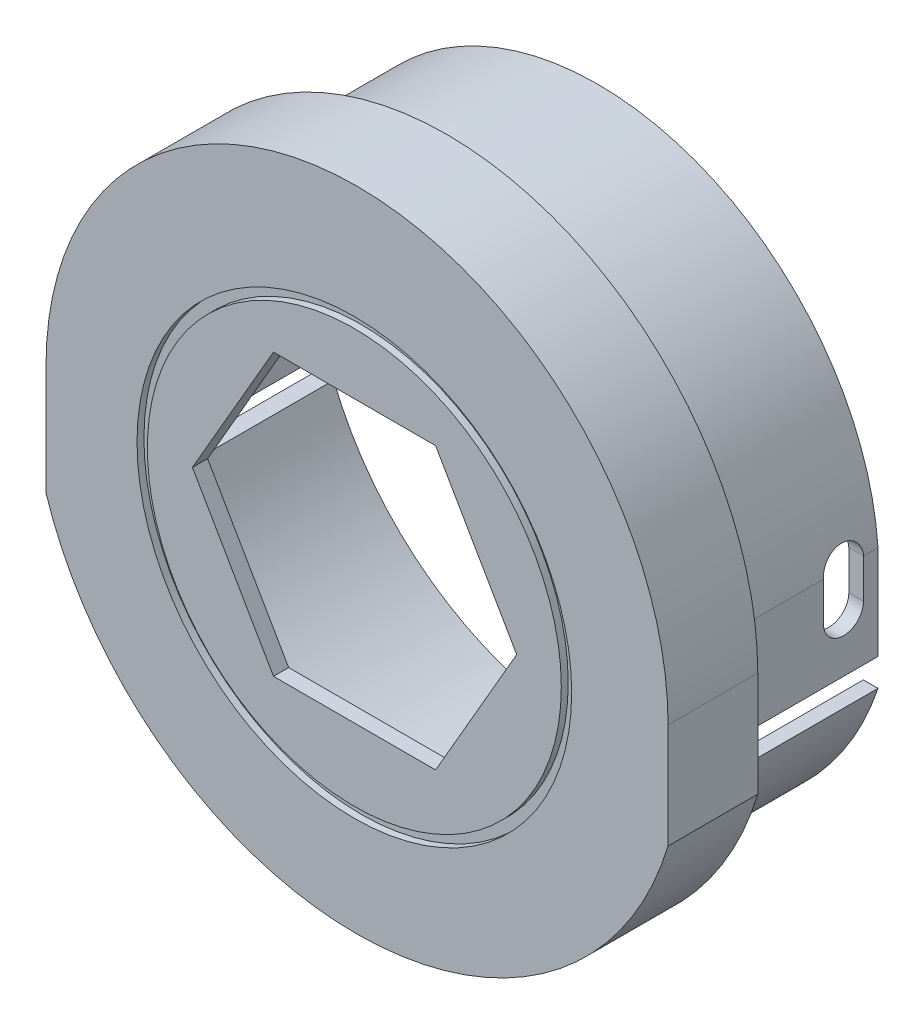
ISO-10303-21;
HEADER;
FILE_DESCRIPTION(('STEP AP214'),'2;1');
FILE_NAME('part.step','',(''),(''),'','','');
FILE_SCHEMA(('AUTOMOTIVE_DESIGN { 1 0 10303 214 1 1 1 1 }'));
ENDSEC;
DATA;
#1=APPLICATION_CONTEXT('core data for automotive mechanical design processes');
#2=APPLICATION_PROTOCOL_DEFINITION('international standard','automotive_design',2000,#1);
#3=PRODUCT_CONTEXT('',#1,'mechanical');
#4=PRODUCT('Part','Part','',(#3));
#5=PRODUCT_RELATED_PRODUCT_CATEGORY('part','',(#4));
#6=PRODUCT_DEFINITION_FORMATION('','',#4);
#7=PRODUCT_DEFINITION_CONTEXT('part definition',#1,'design');
#8=PRODUCT_DEFINITION('design','',#6,#7);
#9=PRODUCT_DEFINITION_SHAPE('','',#8);
#10=(LENGTH_UNIT() NAMED_UNIT(*) SI_UNIT(.MILLI.,.METRE.));
#11=(NAMED_UNIT(*) PLANE_ANGLE_UNIT() SI_UNIT($,.RADIAN.));
#12=(NAMED_UNIT(*) SI_UNIT($,.STERADIAN.) SOLID_ANGLE_UNIT());
#13=UNCERTAINTY_MEASURE_WITH_UNIT(LENGTH_MEASURE(1.E-05),#10,'distance_accuracy_value','');
#14=(GEOMETRIC_REPRESENTATION_CONTEXT(3) GLOBAL_UNCERTAINTY_ASSIGNED_CONTEXT((#13)) GLOBAL_UNIT_ASSIGNED_CONTEXT((#10,
#11,#12)) REPRESENTATION_CONTEXT('',''));
#15=CARTESIAN_POINT('',(0.,0.,0.));
#16=DIRECTION('',(0.,0.,1.));
#17=DIRECTION('',(1.,0.,0.));
#18=AXIS2_PLACEMENT_3D('',#15,#16,#17);
#19=CARTESIAN_POINT('',(-0.734817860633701,-1.45798683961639,-16.));
#20=DIRECTION('',(0.,0.,1.));
#21=DIRECTION('',(1.,0.,0.));
#22=AXIS2_PLACEMENT_3D('',#19,#20,#21);
#23=PLANE('',#22);
#24=DIRECTION('',(0.,-1.,0.));
#25=VECTOR('',#24,1.);
#26=CARTESIAN_POINT('',(19.5746777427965,-0.0324930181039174,-16.));
#27=LINE('',#26,#25);
#28=CARTESIAN_POINT('',(19.5746777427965,-0.0324930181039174,-16.));
#29=VERTEX_POINT('',#28);
#30=CARTESIAN_POINT('',(19.5746777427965,-6.86184549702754,-16.));
#31=VERTEX_POINT('',#30);
#32=EDGE_CURVE('E677',#29,#31,#27,.T.);
#33=ORIENTED_EDGE('',*,*,#32,.T.);
#34=DIRECTION('',(1.,0.,0.));
#35=VECTOR('',#34,1.);
#36=CARTESIAN_POINT('',(19.5746777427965,-6.86184549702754,-16.));
#37=LINE('',#36,#35);
#38=CARTESIAN_POINT('',(18.5111949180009,-6.86184549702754,-16.));
#39=VERTEX_POINT('',#38);
#40=EDGE_CURVE('E900',#39,#31,#37,.T.);
#41=ORIENTED_EDGE('',*,*,#40,.F.);
#42=DIRECTION('',(0.,-1.,0.));
#43=VECTOR('',#42,1.);
#44=CARTESIAN_POINT('',(18.5111949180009,-8.86184549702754,-16.));
#45=LINE('',#44,#43);
#46=CARTESIAN_POINT('',(18.5111949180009,-0.0324930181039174,-16.));
#47=VERTEX_POINT('',#46);
#48=EDGE_CURVE('E627',#47,#39,#45,.T.);
#49=ORIENTED_EDGE('',*,*,#48,.F.);
#50=CARTESIAN_POINT('',(-0.667620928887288,-1.51266022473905,-16.));
#51=DIRECTION('',(0.,0.,-1.));
#52=DIRECTION('',(1.,0.,0.));
#53=AXIS2_PLACEMENT_3D('',#50,#51,#52);
#54=CIRCLE('',#53,19.2358486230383);
#55=CARTESIAN_POINT('',(-19.8703513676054,-0.384380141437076,-16.));
#56=VERTEX_POINT('',#55);
#57=EDGE_CURVE('E634',#56,#47,#54,.T.);
#58=ORIENTED_EDGE('',*,*,#57,.F.);
#59=DIRECTION('',(0.,1.,0.));
#60=VECTOR('',#59,1.);
#61=CARTESIAN_POINT('',(-19.8703513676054,-0.384380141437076,-16.));
#62=LINE('',#61,#60);
#63=CARTESIAN_POINT('',(-19.8703513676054,-7.2462256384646,-16.));
#64=VERTEX_POINT('',#63);
#65=EDGE_CURVE('E626',#64,#56,#62,.T.);
#66=ORIENTED_EDGE('',*,*,#65,.F.);
#67=DIRECTION('',(1.,0.,0.));
#68=VECTOR('',#67,1.);
#69=CARTESIAN_POINT('',(-21.0659519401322,-7.2462256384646,-16.));
#70=LINE('',#69,#68);
#71=CARTESIAN_POINT('',(-21.0659519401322,-7.2462256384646,-16.));
#72=VERTEX_POINT('',#71);
#73=EDGE_CURVE('E824',#72,#64,#70,.T.);
#74=ORIENTED_EDGE('',*,*,#73,.F.);
#75=DIRECTION('',(0.,1.,0.));
#76=VECTOR('',#75,1.);
#77=CARTESIAN_POINT('',(-21.0659519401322,-0.384380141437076,-16.));
#78=LINE('',#77,#76);
#79=CARTESIAN_POINT('',(-21.0659519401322,-0.384380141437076,-16.));
#80=VERTEX_POINT('',#79);
#81=EDGE_CURVE('E684',#72,#80,#78,.T.);
#82=ORIENTED_EDGE('',*,*,#81,.T.);
#83=CARTESIAN_POINT('',(-0.734817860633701,-1.45798683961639,-16.));
#84=DIRECTION('',(0.,0.,-1.));
#85=DIRECTION('',(1.,0.,0.));
#86=AXIS2_PLACEMENT_3D('',#83,#84,#85);
#87=CIRCLE('',#86,20.3594608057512);
#88=EDGE_CURVE('E673',#80,#29,#87,.T.);
#89=ORIENTED_EDGE('',*,*,#88,.T.);
#90=EDGE_LOOP('',(#33,#41,#49,#58,#66,#74,#82,#89));
#91=FACE_BOUND('',#90,.T.);
#92=ADVANCED_FACE('F43',(#91),#23,.F.);
#93=CARTESIAN_POINT('',(-0.679733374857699,-1.26250342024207,1.5));
#94=DIRECTION('',(0.,0.,-1.));
#95=DIRECTION('',(-1.,0.,0.));
#96=AXIS2_PLACEMENT_3D('',#93,#94,#95);
#97=PLANE('',#96);
#98=DIRECTION('',(1.,0.,0.));
#99=VECTOR('',#98,1.);
#100=CARTESIAN_POINT('',(-6.7350468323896,7.83840354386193,1.5));
#101=LINE('',#100,#99);
#102=CARTESIAN_POINT('',(-6.7350468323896,7.83840354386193,1.5));
#103=VERTEX_POINT('',#102);
#104=CARTESIAN_POINT('',(5.0149531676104,7.83840354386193,1.5));
#105=VERTEX_POINT('',#104);
#106=EDGE_CURVE('E747',#103,#105,#101,.T.);
#107=ORIENTED_EDGE('',*,*,#106,.T.);
#108=DIRECTION('',(0.5,-0.866025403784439,0.));
#109=VECTOR('',#108,1.);
#110=CARTESIAN_POINT('',(5.0149531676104,7.83840354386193,1.5));
#111=LINE('',#110,#109);
#112=CARTESIAN_POINT('',(10.8899531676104,-2.33739495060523,1.5));
#113=VERTEX_POINT('',#112);
#114=EDGE_CURVE('E724',#105,#113,#111,.T.);
#115=ORIENTED_EDGE('',*,*,#114,.T.);
#116=DIRECTION('',(-0.5,-0.866025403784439,0.));
#117=VECTOR('',#116,1.);
#118=CARTESIAN_POINT('',(10.8899531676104,-2.33739495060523,1.5));
#119=LINE('',#118,#117);
#120=CARTESIAN_POINT('',(5.0149531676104,-12.5131934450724,1.5));
#121=VERTEX_POINT('',#120);
#122=EDGE_CURVE('E731',#113,#121,#119,.T.);
#123=ORIENTED_EDGE('',*,*,#122,.T.);
#124=DIRECTION('',(-1.,0.,0.));
#125=VECTOR('',#124,1.);
#126=CARTESIAN_POINT('',(5.0149531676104,-12.5131934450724,1.5));
#127=LINE('',#126,#125);
#128=CARTESIAN_POINT('',(-6.73504683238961,-12.5131934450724,1.5));
#129=VERTEX_POINT('',#128);
#130=EDGE_CURVE('E735',#121,#129,#127,.T.);
#131=ORIENTED_EDGE('',*,*,#130,.T.);
#132=DIRECTION('',(-0.5,0.866025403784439,0.));
#133=VECTOR('',#132,1.);
#134=CARTESIAN_POINT('',(-6.73504683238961,-12.5131934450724,1.5));
#135=LINE('',#134,#133);
#136=CARTESIAN_POINT('',(-12.6100468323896,-2.33739495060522,1.5));
#137=VERTEX_POINT('',#136);
#138=EDGE_CURVE('E739',#129,#137,#135,.T.);
#139=ORIENTED_EDGE('',*,*,#138,.T.);
#140=DIRECTION('',(0.5,0.866025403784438,0.));
#141=VECTOR('',#140,1.);
#142=CARTESIAN_POINT('',(-12.6100468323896,-2.33739495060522,1.5));
#143=LINE('',#142,#141);
#144=EDGE_CURVE('E743',#137,#103,#143,.T.);
#145=ORIENTED_EDGE('',*,*,#144,.T.);
#146=EDGE_LOOP('',(#107,#115,#123,#131,#139,#145));
#147=FACE_BOUND('',#146,.T.);
#148=CARTESIAN_POINT('',(-0.874749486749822,-2.74938077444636,1.5));
#149=DIRECTION('',(0.,0.,1.));
#150=DIRECTION('',(1.,0.,0.));
#151=AXIS2_PLACEMENT_3D('',#148,#149,#150);
#152=CIRCLE('',#151,15.);
#153=CARTESIAN_POINT('',(14.1252505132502,-2.74938077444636,1.5));
#154=VERTEX_POINT('',#153);
#155=EDGE_CURVE('E711',#154,#154,#152,.T.);
#156=ORIENTED_EDGE('',*,*,#155,.T.);
#157=EDGE_LOOP('',(#156));
#158=FACE_BOUND('',#157,.T.);
#159=ADVANCED_FACE('F584',(#147,#158),#97,.F.);
#160=CARTESIAN_POINT('',(-0.679733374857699,-1.26250342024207,1.5));
#161=DIRECTION('',(0.,0.,-1.));
#162=DIRECTION('',(-1.,0.,0.));
#163=AXIS2_PLACEMENT_3D('',#160,#161,#162);
#164=CYLINDRICAL_SURFACE('',#163,22.5409282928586);
#165=DIRECTION('',(0.,0.,-1.));
#166=VECTOR('',#165,1.);
#167=CARTESIAN_POINT('',(21.8611949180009,-1.26250342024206,1.5));
#168=LINE('',#167,#166);
#169=CARTESIAN_POINT('',(21.8611949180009,-1.26250342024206,1.5));
#170=VERTEX_POINT('',#169);
#171=CARTESIAN_POINT('',(21.8611949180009,-1.26250342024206,-5.));
#172=VERTEX_POINT('',#171);
#173=EDGE_CURVE('E788',#170,#172,#168,.T.);
#174=ORIENTED_EDGE('',*,*,#173,.T.);
#175=CARTESIAN_POINT('',(-0.679733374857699,-1.2625034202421,-5.));
#176=DIRECTION('',(0.,0.,-1.));
#177=DIRECTION('',(1.,0.,0.));
#178=AXIS2_PLACEMENT_3D('',#175,#176,#177);
#179=CIRCLE('',#178,22.5409282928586);
#180=CARTESIAN_POINT('',(-23.2206616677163,-1.26250342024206,-5.));
#181=VERTEX_POINT('',#180);
#182=EDGE_CURVE('E842',#181,#172,#179,.T.);
#183=ORIENTED_EDGE('',*,*,#182,.F.);
#184=DIRECTION('',(0.,0.,-1.));
#185=VECTOR('',#184,1.);
#186=CARTESIAN_POINT('',(-23.2206616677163,-1.26250342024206,1.5));
#187=LINE('',#186,#185);
#188=CARTESIAN_POINT('',(-23.2206616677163,-1.26250342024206,1.5));
#189=VERTEX_POINT('',#188);
#190=EDGE_CURVE('E797',#189,#181,#187,.T.);
#191=ORIENTED_EDGE('',*,*,#190,.F.);
#192=CARTESIAN_POINT('',(-0.679733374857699,-1.26250342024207,1.5));
#193=DIRECTION('',(0.,0.,1.));
#194=DIRECTION('',(-1.,0.,0.));
#195=AXIS2_PLACEMENT_3D('',#192,#193,#194);
#196=CIRCLE('',#195,22.5409282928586);
#197=EDGE_CURVE('E756',#170,#189,#196,.T.);
#198=ORIENTED_EDGE('',*,*,#197,.F.);
#199=EDGE_LOOP('',(#174,#183,#191,#198));
#200=FACE_BOUND('',#199,.T.);
#201=ADVANCED_FACE('F45',(#200),#164,.T.);
#202=CARTESIAN_POINT('',(-23.2206616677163,-1.26250342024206,1.5));
#203=DIRECTION('',(1.,0.,0.));
#204=DIRECTION('',(0.,0.,-1.));
#205=AXIS2_PLACEMENT_3D('',#202,#203,#204);
#206=PLANE('',#205);
#207=ORIENTED_EDGE('',*,*,#190,.T.);
#208=DIRECTION('',(0.,1.,0.));
#209=VECTOR('',#208,1.);
#210=CARTESIAN_POINT('',(-23.2206616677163,-1.26250342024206,-5.));
#211=LINE('',#210,#209);
#212=CARTESIAN_POINT('',(-23.2206616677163,-9.24622563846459,-5.));
#213=VERTEX_POINT('',#212);
#214=EDGE_CURVE('E643',#213,#181,#211,.T.);
#215=ORIENTED_EDGE('',*,*,#214,.F.);
#216=DIRECTION('',(0.,0.,-1.));
#217=VECTOR('',#216,1.);
#218=CARTESIAN_POINT('',(-23.2206616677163,-9.24622563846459,1.5));
#219=LINE('',#218,#217);
#220=CARTESIAN_POINT('',(-23.2206616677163,-9.24622563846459,1.5));
#221=VERTEX_POINT('',#220);
#222=EDGE_CURVE('E794',#221,#213,#219,.T.);
#223=ORIENTED_EDGE('',*,*,#222,.F.);
#224=DIRECTION('',(0.,-1.,0.));
#225=VECTOR('',#224,1.);
#226=CARTESIAN_POINT('',(-23.2206616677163,-1.26250342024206,1.5));
#227=LINE('',#226,#225);
#228=EDGE_CURVE('E779',#189,#221,#227,.T.);
#229=ORIENTED_EDGE('',*,*,#228,.F.);
#230=EDGE_LOOP('',(#207,#215,#223,#229));
#231=FACE_BOUND('',#230,.T.);
#232=ADVANCED_FACE('F593',(#231),#206,.F.);
#233=CARTESIAN_POINT('',(-0.739326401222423,-2.0646935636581,1.5));
#234=DIRECTION('',(0.,0.,-1.));
#235=DIRECTION('',(-1.,0.,0.));
#236=AXIS2_PLACEMENT_3D('',#233,#234,#235);
#237=CYLINDRICAL_SURFACE('',#236,23.6005262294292);
#238=ORIENTED_EDGE('',*,*,#222,.T.);
#239=CARTESIAN_POINT('',(-0.739326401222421,-2.06469356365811,-5.));
#240=DIRECTION('',(0.,0.,-1.));
#241=DIRECTION('',(-1.,0.,0.));
#242=AXIS2_PLACEMENT_3D('',#239,#240,#241);
#243=CIRCLE('',#242,23.6005262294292);
#244=CARTESIAN_POINT('',(21.8611949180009,-8.86184549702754,-5.));
#245=VERTEX_POINT('',#244);
#246=EDGE_CURVE('E834',#245,#213,#243,.T.);
#247=ORIENTED_EDGE('',*,*,#246,.F.);
#248=DIRECTION('',(0.,0.,-1.));
#249=VECTOR('',#248,1.);
#250=CARTESIAN_POINT('',(21.8611949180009,-8.86184549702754,1.5));
#251=LINE('',#250,#249);
#252=CARTESIAN_POINT('',(21.8611949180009,-8.86184549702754,1.5));
#253=VERTEX_POINT('',#252);
#254=EDGE_CURVE('E791',#253,#245,#251,.T.);
#255=ORIENTED_EDGE('',*,*,#254,.F.);
#256=CARTESIAN_POINT('',(-0.739326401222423,-2.0646935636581,1.5));
#257=DIRECTION('',(0.,0.,1.));
#258=DIRECTION('',(1.,0.,0.));
#259=AXIS2_PLACEMENT_3D('',#256,#257,#258);
#260=CIRCLE('',#259,23.6005262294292);
#261=EDGE_CURVE('E782',#221,#253,#260,.T.);
#262=ORIENTED_EDGE('',*,*,#261,.F.);
#263=EDGE_LOOP('',(#238,#247,#255,#262));
#264=FACE_BOUND('',#263,.T.);
#265=ADVANCED_FACE('F590',(#264),#237,.T.);
#266=CARTESIAN_POINT('',(21.8611949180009,-1.26250342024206,1.5));
#267=DIRECTION('',(-1.,0.,0.));
#268=DIRECTION('',(0.,0.,1.));
#269=AXIS2_PLACEMENT_3D('',#266,#267,#268);
#270=PLANE('',#269);
#271=ORIENTED_EDGE('',*,*,#254,.T.);
#272=DIRECTION('',(0.,-1.,0.));
#273=VECTOR('',#272,1.);
#274=CARTESIAN_POINT('',(21.8611949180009,-1.26250342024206,-5.));
#275=LINE('',#274,#273);
#276=EDGE_CURVE('E838',#172,#245,#275,.T.);
#277=ORIENTED_EDGE('',*,*,#276,.F.);
#278=ORIENTED_EDGE('',*,*,#173,.F.);
#279=DIRECTION('',(0.,1.,0.));
#280=VECTOR('',#279,1.);
#281=CARTESIAN_POINT('',(21.8611949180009,-1.26250342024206,1.5));
#282=LINE('',#281,#280);
#283=EDGE_CURVE('E785',#253,#170,#282,.T.);
#284=ORIENTED_EDGE('',*,*,#283,.F.);
#285=EDGE_LOOP('',(#271,#277,#278,#284));
#286=FACE_BOUND('',#285,.T.);
#287=ADVANCED_FACE('F582',(#286),#270,.F.);
#288=CARTESIAN_POINT('',(-0.874749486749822,-2.74938077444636,1.5));
#289=DIRECTION('',(0.,0.,1.));
#290=DIRECTION('',(1.,0.,0.));
#291=AXIS2_PLACEMENT_3D('',#288,#289,#290);
#292=CIRCLE('',#291,15.75);
#293=CARTESIAN_POINT('',(14.8752505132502,-2.74938077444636,1.5));
#294=VERTEX_POINT('',#293);
#295=EDGE_CURVE('E716',#294,#294,#292,.T.);
#296=ORIENTED_EDGE('',*,*,#295,.F.);
#297=EDGE_LOOP('',(#296));
#298=FACE_BOUND('',#297,.T.);
#299=ORIENTED_EDGE('',*,*,#197,.T.);
#300=ORIENTED_EDGE('',*,*,#228,.T.);
#301=ORIENTED_EDGE('',*,*,#261,.T.);
#302=ORIENTED_EDGE('',*,*,#283,.T.);
#303=EDGE_LOOP('',(#299,#300,#301,#302));
#304=FACE_BOUND('',#303,.T.);
#305=ADVANCED_FACE('F579',(#298,#304),#97,.F.);
#306=CARTESIAN_POINT('',(-0.679733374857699,-1.26250342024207,0.));
#307=DIRECTION('',(0.,0.,-1.));
#308=DIRECTION('',(-1.,0.,0.));
#309=AXIS2_PLACEMENT_3D('',#306,#307,#308);
#310=PLANE('',#309);
#311=CARTESIAN_POINT('',(-0.939605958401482,-1.14580730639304,0.));
#312=DIRECTION('',(0.,0.,-1.));
#313=DIRECTION('',(1.,0.,0.));
#314=AXIS2_PLACEMENT_3D('',#311,#312,#313);
#315=CIRCLE('',#314,13.0893152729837);
#316=CARTESIAN_POINT('',(-8.12469155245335,9.79515788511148,0.));
#317=VERTEX_POINT('',#316);
#318=CARTESIAN_POINT('',(6.72972147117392,9.46134080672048,0.));
#319=VERTEX_POINT('',#318);
#320=EDGE_CURVE('E59',#317,#319,#315,.T.);
#321=ORIENTED_EDGE('',*,*,#320,.F.);
#322=DIRECTION('',(0.486004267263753,0.873956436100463,0.));
#323=VECTOR('',#322,1.);
#324=CARTESIAN_POINT('',(-8.12469155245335,9.79515788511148,0.));
#325=LINE('',#324,#323);
#326=CARTESIAN_POINT('',(-14.7429360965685,-2.10609032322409,0.));
#327=VERTEX_POINT('',#326);
#328=EDGE_CURVE('E389',#327,#317,#325,.T.);
#329=ORIENTED_EDGE('',*,*,#328,.F.);
#330=CARTESIAN_POINT('',(-1.41115773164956,-2.92823275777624,0.));
#331=DIRECTION('',(0.,0.,-1.));
#332=DIRECTION('',(1.,0.,0.));
#333=AXIS2_PLACEMENT_3D('',#330,#331,#332);
#334=CIRCLE('',#333,13.357104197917);
#335=CARTESIAN_POINT('',(-7.71732768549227,-14.7029706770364,0.));
#336=VERTEX_POINT('',#335);
#337=EDGE_CURVE('E424',#336,#327,#334,.T.);
#338=ORIENTED_EDGE('',*,*,#337,.F.);
#339=DIRECTION('',(-1.,0.,0.));
#340=VECTOR('',#339,1.);
#341=CARTESIAN_POINT('',(-7.71732768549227,-14.7029706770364,0.));
#342=LINE('',#341,#340);
#343=CARTESIAN_POINT('',(5.88442560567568,-14.7029706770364,0.));
#344=VERTEX_POINT('',#343);
#345=EDGE_CURVE('E420',#344,#336,#342,.T.);
#346=ORIENTED_EDGE('',*,*,#345,.F.);
#347=CARTESIAN_POINT('',(-0.615326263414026,-2.42933178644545,0.));
#348=DIRECTION('',(0.,0.,-1.));
#349=DIRECTION('',(1.,0.,0.));
#350=AXIS2_PLACEMENT_3D('',#347,#348,#349);
#351=CIRCLE('',#350,13.8884479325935);
#352=CARTESIAN_POINT('',(13.2716214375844,-2.63346293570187,0.));
#353=VERTEX_POINT('',#352);
#354=EDGE_CURVE('E416',#353,#344,#351,.T.);
#355=ORIENTED_EDGE('',*,*,#354,.F.);
#356=DIRECTION('',(0.475751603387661,-0.879579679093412,0.));
#357=VECTOR('',#356,1.);
#358=CARTESIAN_POINT('',(13.2716214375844,-2.63346293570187,0.));
#359=LINE('',#358,#357);
#360=EDGE_CURVE('E412',#319,#353,#359,.T.);
#361=ORIENTED_EDGE('',*,*,#360,.F.);
#362=EDGE_LOOP('',(#321,#329,#338,#346,#355,#361));
#363=FACE_BOUND('',#362,.T.);
#364=CARTESIAN_POINT('',(-0.667620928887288,-1.51266022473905,0.));
#365=DIRECTION('',(0.,0.,-1.));
#366=DIRECTION('',(1.,0.,0.));
#367=AXIS2_PLACEMENT_3D('',#364,#365,#366);
#368=CIRCLE('',#367,19.2358486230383);
#369=CARTESIAN_POINT('',(-19.8703513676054,-0.384380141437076,0.));
#370=VERTEX_POINT('',#369);
#371=CARTESIAN_POINT('',(18.5111949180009,-0.0324930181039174,0.));
#372=VERTEX_POINT('',#371);
#373=EDGE_CURVE('E638',#370,#372,#368,.T.);
#374=ORIENTED_EDGE('',*,*,#373,.T.);
#375=DIRECTION('',(0.,-1.,0.));
#376=VECTOR('',#375,1.);
#377=CARTESIAN_POINT('',(18.5111949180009,-8.86184549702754,0.));
#378=LINE('',#377,#376);
#379=CARTESIAN_POINT('',(18.5111949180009,-8.86184549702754,0.));
#380=VERTEX_POINT('',#379);
#381=EDGE_CURVE('E642',#372,#380,#378,.T.);
#382=ORIENTED_EDGE('',*,*,#381,.T.);
#383=CARTESIAN_POINT('',(-0.753743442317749,-1.64840915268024,0.));
#384=DIRECTION('',(0.,0.,-1.));
#385=DIRECTION('',(-1.,0.,0.));
#386=AXIS2_PLACEMENT_3D('',#383,#384,#385);
#387=CIRCLE('',#386,20.5711330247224);
#388=CARTESIAN_POINT('',(-19.8703513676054,-9.2462256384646,0.));
#389=VERTEX_POINT('',#388);
#390=EDGE_CURVE('E647',#380,#389,#387,.T.);
#391=ORIENTED_EDGE('',*,*,#390,.T.);
#392=DIRECTION('',(0.,1.,0.));
#393=VECTOR('',#392,1.);
#394=CARTESIAN_POINT('',(-19.8703513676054,-0.384380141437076,0.));
#395=LINE('',#394,#393);
#396=EDGE_CURVE('E651',#389,#370,#395,.T.);
#397=ORIENTED_EDGE('',*,*,#396,.T.);
#398=EDGE_LOOP('',(#374,#382,#391,#397));
#399=FACE_BOUND('',#398,.T.);
#400=ADVANCED_FACE('F577',(#363,#399),#310,.T.);
#401=CARTESIAN_POINT('',(5.0149531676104,7.83840354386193,1.5));
#402=DIRECTION('',(0.866025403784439,0.5,0.));
#403=DIRECTION('',(-0.5,0.866025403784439,0.));
#404=AXIS2_PLACEMENT_3D('',#401,#402,#403);
#405=PLANE('',#404);
#406=DIRECTION('',(0.,0.,-1.));
#407=VECTOR('',#406,1.);
#408=CARTESIAN_POINT('',(5.0149531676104,7.83840354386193,1.5));
#409=LINE('',#408,#407);
#410=CARTESIAN_POINT('',(5.0149531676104,7.83840354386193,0.4));
#411=VERTEX_POINT('',#410);
#412=EDGE_CURVE('E752',#105,#411,#409,.T.);
#413=ORIENTED_EDGE('',*,*,#412,.T.);
#414=DIRECTION('',(0.5,-0.866025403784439,0.));
#415=VECTOR('',#414,1.);
#416=CARTESIAN_POINT('',(5.0149531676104,7.83840354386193,0.4));
#417=LINE('',#416,#415);
#418=CARTESIAN_POINT('',(10.8899531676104,-2.33739495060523,0.4));
#419=VERTEX_POINT('',#418);
#420=EDGE_CURVE('E462',#411,#419,#417,.T.);
#421=ORIENTED_EDGE('',*,*,#420,.T.);
#422=DIRECTION('',(0.,0.,-1.));
#423=VECTOR('',#422,1.);
#424=CARTESIAN_POINT('',(10.8899531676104,-2.33739495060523,1.5));
#425=LINE('',#424,#423);
#426=EDGE_CURVE('E751',#113,#419,#425,.T.);
#427=ORIENTED_EDGE('',*,*,#426,.F.);
#428=ORIENTED_EDGE('',*,*,#114,.F.);
#429=EDGE_LOOP('',(#413,#421,#427,#428));
#430=FACE_BOUND('',#429,.T.);
#431=ADVANCED_FACE('F559',(#430),#405,.F.);
#432=CARTESIAN_POINT('',(-6.7350468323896,7.83840354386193,1.5));
#433=DIRECTION('',(0.,1.,0.));
#434=DIRECTION('',(0.,0.,1.));
#435=AXIS2_PLACEMENT_3D('',#432,#433,#434);
#436=PLANE('',#435);
#437=DIRECTION('',(0.,0.,-1.));
#438=VECTOR('',#437,1.);
#439=CARTESIAN_POINT('',(-6.7350468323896,7.83840354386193,1.5));
#440=LINE('',#439,#438);
#441=CARTESIAN_POINT('',(-6.7350468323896,7.83840354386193,0.4));
#442=VERTEX_POINT('',#441);
#443=EDGE_CURVE('E757',#103,#442,#440,.T.);
#444=ORIENTED_EDGE('',*,*,#443,.T.);
#445=DIRECTION('',(1.,0.,0.));
#446=VECTOR('',#445,1.);
#447=CARTESIAN_POINT('',(-6.7350468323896,7.83840354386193,0.4));
#448=LINE('',#447,#446);
#449=EDGE_CURVE('E458',#442,#411,#448,.T.);
#450=ORIENTED_EDGE('',*,*,#449,.T.);
#451=ORIENTED_EDGE('',*,*,#412,.F.);
#452=ORIENTED_EDGE('',*,*,#106,.F.);
#453=EDGE_LOOP('',(#444,#450,#451,#452));
#454=FACE_BOUND('',#453,.T.);
#455=ADVANCED_FACE('F555',(#454),#436,.F.);
#456=CARTESIAN_POINT('',(-12.6100468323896,-2.33739495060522,1.5));
#457=DIRECTION('',(-0.866025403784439,0.5,0.));
#458=DIRECTION('',(-0.5,-0.866025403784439,0.));
#459=AXIS2_PLACEMENT_3D('',#456,#457,#458);
#460=PLANE('',#459);
#461=DIRECTION('',(0.,0.,-1.));
#462=VECTOR('',#461,1.);
#463=CARTESIAN_POINT('',(-12.6100468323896,-2.33739495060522,1.5));
#464=LINE('',#463,#462);
#465=CARTESIAN_POINT('',(-12.6100468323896,-2.33739495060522,0.4));
#466=VERTEX_POINT('',#465);
#467=EDGE_CURVE('E761',#137,#466,#464,.T.);
#468=ORIENTED_EDGE('',*,*,#467,.T.);
#469=DIRECTION('',(0.5,0.866025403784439,0.));
#470=VECTOR('',#469,1.);
#471=CARTESIAN_POINT('',(-12.6100468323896,-2.33739495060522,0.4));
#472=LINE('',#471,#470);
#473=EDGE_CURVE('E454',#466,#442,#472,.T.);
#474=ORIENTED_EDGE('',*,*,#473,.T.);
#475=ORIENTED_EDGE('',*,*,#443,.F.);
#476=ORIENTED_EDGE('',*,*,#144,.F.);
#477=EDGE_LOOP('',(#468,#474,#475,#476));
#478=FACE_BOUND('',#477,.T.);
#479=ADVANCED_FACE('F558',(#478),#460,.F.);
#480=CARTESIAN_POINT('',(-6.73504683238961,-12.5131934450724,1.5));
#481=DIRECTION('',(-0.866025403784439,-0.5,0.));
#482=DIRECTION('',(0.5,-0.866025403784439,0.));
#483=AXIS2_PLACEMENT_3D('',#480,#481,#482);
#484=PLANE('',#483);
#485=DIRECTION('',(0.,0.,-1.));
#486=VECTOR('',#485,1.);
#487=CARTESIAN_POINT('',(-6.73504683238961,-12.5131934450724,1.5));
#488=LINE('',#487,#486);
#489=CARTESIAN_POINT('',(-6.73504683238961,-12.5131934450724,0.4));
#490=VERTEX_POINT('',#489);
#491=EDGE_CURVE('E765',#129,#490,#488,.T.);
#492=ORIENTED_EDGE('',*,*,#491,.T.);
#493=DIRECTION('',(-0.5,0.866025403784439,0.));
#494=VECTOR('',#493,1.);
#495=CARTESIAN_POINT('',(-6.73504683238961,-12.5131934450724,0.4));
#496=LINE('',#495,#494);
#497=EDGE_CURVE('E450',#490,#466,#496,.T.);
#498=ORIENTED_EDGE('',*,*,#497,.T.);
#499=ORIENTED_EDGE('',*,*,#467,.F.);
#500=ORIENTED_EDGE('',*,*,#138,.F.);
#501=EDGE_LOOP('',(#492,#498,#499,#500));
#502=FACE_BOUND('',#501,.T.);
#503=ADVANCED_FACE('F563',(#502),#484,.F.);
#504=CARTESIAN_POINT('',(5.0149531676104,-12.5131934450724,1.5));
#505=DIRECTION('',(0.,-1.,0.));
#506=DIRECTION('',(1.,0.,0.));
#507=AXIS2_PLACEMENT_3D('',#504,#505,#506);
#508=PLANE('',#507);
#509=DIRECTION('',(0.,0.,-1.));
#510=VECTOR('',#509,1.);
#511=CARTESIAN_POINT('',(5.0149531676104,-12.5131934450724,1.5));
#512=LINE('',#511,#510);
#513=CARTESIAN_POINT('',(5.0149531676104,-12.5131934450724,0.4));
#514=VERTEX_POINT('',#513);
#515=EDGE_CURVE('E769',#121,#514,#512,.T.);
#516=ORIENTED_EDGE('',*,*,#515,.T.);
#517=DIRECTION('',(-1.,0.,0.));
#518=VECTOR('',#517,1.);
#519=CARTESIAN_POINT('',(5.0149531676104,-12.5131934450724,0.4));
#520=LINE('',#519,#518);
#521=EDGE_CURVE('E67',#514,#490,#520,.T.);
#522=ORIENTED_EDGE('',*,*,#521,.T.);
#523=ORIENTED_EDGE('',*,*,#491,.F.);
#524=ORIENTED_EDGE('',*,*,#130,.F.);
#525=EDGE_LOOP('',(#516,#522,#523,#524));
#526=FACE_BOUND('',#525,.T.);
#527=ADVANCED_FACE('F567',(#526),#508,.F.);
#528=CARTESIAN_POINT('',(10.8899531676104,-2.33739495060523,1.5));
#529=DIRECTION('',(0.866025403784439,-0.5,0.));
#530=DIRECTION('',(0.5,0.866025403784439,0.));
#531=AXIS2_PLACEMENT_3D('',#528,#529,#530);
#532=PLANE('',#531);
#533=ORIENTED_EDGE('',*,*,#426,.T.);
#534=DIRECTION('',(-0.5,-0.866025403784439,0.));
#535=VECTOR('',#534,1.);
#536=CARTESIAN_POINT('',(10.8899531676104,-2.33739495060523,0.4));
#537=LINE('',#536,#535);
#538=EDGE_CURVE('E11',#419,#514,#537,.T.);
#539=ORIENTED_EDGE('',*,*,#538,.T.);
#540=ORIENTED_EDGE('',*,*,#515,.F.);
#541=ORIENTED_EDGE('',*,*,#122,.F.);
#542=EDGE_LOOP('',(#533,#539,#540,#541));
#543=FACE_BOUND('',#542,.T.);
#544=ADVANCED_FACE('F553',(#543),#532,.F.);
#545=CARTESIAN_POINT('',(-0.874749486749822,-2.74938077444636,1.));
#546=DIRECTION('',(0.,0.,1.));
#547=DIRECTION('',(1.,0.,0.));
#548=AXIS2_PLACEMENT_3D('',#545,#546,#547);
#549=CYLINDRICAL_SURFACE('',#548,15.75);
#550=CARTESIAN_POINT('',(-0.874749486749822,-2.74938077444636,1.));
#551=DIRECTION('',(0.,0.,1.));
#552=DIRECTION('',(1.,0.,0.));
#553=AXIS2_PLACEMENT_3D('',#550,#551,#552);
#554=CIRCLE('',#553,15.75);
#555=CARTESIAN_POINT('',(14.8752505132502,-2.74938077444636,1.));
#556=VERTEX_POINT('',#555);
#557=EDGE_CURVE('E720',#556,#556,#554,.T.);
#558=ORIENTED_EDGE('',*,*,#557,.F.);
#559=EDGE_LOOP('',(#558));
#560=FACE_BOUND('',#559,.T.);
#561=ORIENTED_EDGE('',*,*,#295,.T.);
#562=EDGE_LOOP('',(#561));
#563=FACE_BOUND('',#562,.T.);
#564=ADVANCED_FACE('F549',(#560,#563),#549,.F.);
#565=CARTESIAN_POINT('',(-0.874749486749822,-2.74938077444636,1.));
#566=DIRECTION('',(0.,0.,1.));
#567=DIRECTION('',(1.,0.,0.));
#568=AXIS2_PLACEMENT_3D('',#565,#566,#567);
#569=PLANE('',#568);
#570=CARTESIAN_POINT('',(-0.874749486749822,-2.74938077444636,1.));
#571=DIRECTION('',(0.,0.,1.));
#572=DIRECTION('',(1.,0.,0.));
#573=AXIS2_PLACEMENT_3D('',#570,#571,#572);
#574=CIRCLE('',#573,15.);
#575=CARTESIAN_POINT('',(14.1252505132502,-2.74938077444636,1.));
#576=VERTEX_POINT('',#575);
#577=EDGE_CURVE('E712',#576,#576,#574,.T.);
#578=ORIENTED_EDGE('',*,*,#577,.F.);
#579=EDGE_LOOP('',(#578));
#580=FACE_BOUND('',#579,.T.);
#581=ORIENTED_EDGE('',*,*,#557,.T.);
#582=EDGE_LOOP('',(#581));
#583=FACE_BOUND('',#582,.T.);
#584=ADVANCED_FACE('F545',(#580,#583),#569,.T.);
#585=CARTESIAN_POINT('',(-0.874749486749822,-2.74938077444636,1.));
#586=DIRECTION('',(0.,0.,1.));
#587=DIRECTION('',(1.,0.,0.));
#588=AXIS2_PLACEMENT_3D('',#585,#586,#587);
#589=CYLINDRICAL_SURFACE('',#588,15.);
#590=ORIENTED_EDGE('',*,*,#577,.T.);
#591=EDGE_LOOP('',(#590));
#592=FACE_BOUND('',#591,.T.);
#593=ORIENTED_EDGE('',*,*,#155,.F.);
#594=EDGE_LOOP('',(#593));
#595=FACE_BOUND('',#594,.T.);
#596=ADVANCED_FACE('F541',(#592,#595),#589,.T.);
#597=CARTESIAN_POINT('',(-0.753743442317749,-1.64840915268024,-16.));
#598=DIRECTION('',(0.,0.,-1.));
#599=DIRECTION('',(-1.,0.,0.));
#600=AXIS2_PLACEMENT_3D('',#597,#598,#599);
#601=CIRCLE('',#600,20.5711330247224);
#602=CARTESIAN_POINT('',(18.5111949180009,-8.86184549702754,-16.));
#603=VERTEX_POINT('',#602);
#604=CARTESIAN_POINT('',(-19.8703513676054,-9.2462256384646,-16.));
#605=VERTEX_POINT('',#604);
#606=EDGE_CURVE('E617',#603,#605,#601,.T.);
#607=ORIENTED_EDGE('',*,*,#606,.F.);
#608=DIRECTION('',(-1.,0.,0.));
#609=VECTOR('',#608,1.);
#610=CARTESIAN_POINT('',(19.5746777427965,-8.86184549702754,-16.));
#611=LINE('',#610,#609);
#612=CARTESIAN_POINT('',(19.5746777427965,-8.86184549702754,-16.));
#613=VERTEX_POINT('',#612);
#614=EDGE_CURVE('E619',#613,#603,#611,.T.);
#615=ORIENTED_EDGE('',*,*,#614,.F.);
#616=CARTESIAN_POINT('',(-0.811438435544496,-2.09684013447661,-16.));
#617=DIRECTION('',(0.,0.,-1.));
#618=DIRECTION('',(-1.,0.,0.));
#619=AXIS2_PLACEMENT_3D('',#616,#617,#618);
#620=CIRCLE('',#619,21.4792697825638);
#621=CARTESIAN_POINT('',(-21.0659519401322,-9.2462256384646,-16.));
#622=VERTEX_POINT('',#621);
#623=EDGE_CURVE('E681',#613,#622,#620,.T.);
#624=ORIENTED_EDGE('',*,*,#623,.T.);
#625=DIRECTION('',(-1.,0.,0.));
#626=VECTOR('',#625,1.);
#627=CARTESIAN_POINT('',(-21.0659519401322,-9.2462256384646,-16.));
#628=LINE('',#627,#626);
#629=EDGE_CURVE('E621',#605,#622,#628,.T.);
#630=ORIENTED_EDGE('',*,*,#629,.F.);
#631=EDGE_LOOP('',(#607,#615,#624,#630));
#632=FACE_BOUND('',#631,.T.);
#633=ADVANCED_FACE('F538',(#632),#23,.F.);
#634=CARTESIAN_POINT('',(-0.734817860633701,-1.45798683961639,-16.));
#635=DIRECTION('',(0.,0.,1.));
#636=DIRECTION('',(1.,0.,0.));
#637=AXIS2_PLACEMENT_3D('',#634,#635,#636);
#638=CYLINDRICAL_SURFACE('',#637,20.3594608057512);
#639=DIRECTION('',(0.,0.,1.));
#640=VECTOR('',#639,1.);
#641=CARTESIAN_POINT('',(-21.0659519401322,-0.384380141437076,-16.));
#642=LINE('',#641,#640);
#643=CARTESIAN_POINT('',(-21.0659519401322,-0.384380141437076,-14.6660713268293));
#644=VERTEX_POINT('',#643);
#645=EDGE_CURVE('E330',#80,#644,#642,.T.);
#646=ORIENTED_EDGE('',*,*,#645,.T.);
#647=CARTESIAN_POINT('',(-21.0659519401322,-0.384380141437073,-14.6660713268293));
#648=CARTESIAN_POINT('',(-21.0642194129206,-0.351567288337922,-14.6418188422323));
#649=CARTESIAN_POINT('',(-21.0624617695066,-0.319794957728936,-14.6161933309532));
#650=CARTESIAN_POINT('',(-21.0589382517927,-0.258522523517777,-14.5623593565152));
#651=CARTESIAN_POINT('',(-21.0571723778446,-0.229022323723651,-14.5341510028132));
#652=CARTESIAN_POINT('',(-21.0519303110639,-0.144295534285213,-14.4459793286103));
#653=CARTESIAN_POINT('',(-21.0485043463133,-0.0927454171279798,-14.3823973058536));
#654=CARTESIAN_POINT('',(-21.0421342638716,-0.00104798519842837,-14.2474617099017));
#655=CARTESIAN_POINT('',(-21.039190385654,0.0390936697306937,-14.176104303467));
#656=CARTESIAN_POINT('',(-21.0340831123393,0.106823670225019,-14.0276444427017));
#657=CARTESIAN_POINT('',(-21.0319195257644,0.134415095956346,-13.9505434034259));
#658=CARTESIAN_POINT('',(-21.0285969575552,0.176215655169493,-13.7929155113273));
#659=CARTESIAN_POINT('',(-21.0274362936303,0.190447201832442,-13.7123946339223));
#660=CARTESIAN_POINT('',(-21.0262326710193,0.2051984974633,-13.5500855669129));
#661=CARTESIAN_POINT('',(-21.0261898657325,0.205716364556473,-13.4682972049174));
#662=CARTESIAN_POINT('',(-21.0272253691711,0.193037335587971,-13.3060175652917));
#663=CARTESIAN_POINT('',(-21.0283007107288,0.179876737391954,-13.2255234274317));
#664=CARTESIAN_POINT('',(-21.0314579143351,0.140273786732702,-13.0678853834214));
#665=CARTESIAN_POINT('',(-21.0335398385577,0.113830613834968,-12.9907416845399));
#666=CARTESIAN_POINT('',(-21.0385006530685,0.0483938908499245,-12.8419123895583));
#667=CARTESIAN_POINT('',(-21.0413804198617,0.00938653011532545,-12.7702329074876));
#668=CARTESIAN_POINT('',(-21.0476454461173,-0.080062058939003,-12.634460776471));
#669=CARTESIAN_POINT('',(-21.0510303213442,-0.130494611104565,-12.5703624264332));
#670=CARTESIAN_POINT('',(-21.0563953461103,-0.216191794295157,-12.478475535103));
#671=CARTESIAN_POINT('',(-21.0583179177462,-0.247990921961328,-12.4473831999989));
#672=CARTESIAN_POINT('',(-21.0621542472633,-0.314246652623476,-12.3882981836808));
#673=CARTESIAN_POINT('',(-21.0640680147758,-0.348698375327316,-12.360300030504));
#674=CARTESIAN_POINT('',(-21.0659519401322,-0.384380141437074,-12.3339286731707));
#675=B_SPLINE_CURVE_WITH_KNOTS('',3,(#647,#648,#649,#650,#651,#652,#653,#654,#655,#656,#657,
#658,#659,#660,#661,#662,#663,#664,#665,#666,#667,#668,#669,#670,#671,#672,#673,#674),
.UNSPECIFIED.,.F.,.F.,(4,2,2,2,2,2,2,2,2,2,2,2,2,4),(0.,0.122443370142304,0.244881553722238,
0.489398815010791,0.734037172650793,0.978615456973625,1.2227826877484,1.46698342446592,
1.71053778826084,1.95410719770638,2.19794525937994,2.44159877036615,2.57497822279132,
2.7081178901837),.UNSPECIFIED.);
#676=CARTESIAN_POINT('',(-21.0659519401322,-0.384380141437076,-12.3339286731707));
#677=VERTEX_POINT('',#676);
#678=EDGE_CURVE('E478',#644,#677,#675,.T.);
#679=ORIENTED_EDGE('',*,*,#678,.T.);
#680=CARTESIAN_POINT('',(-21.0659519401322,-0.384380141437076,0.));
#681=VERTEX_POINT('',#680);
#682=EDGE_CURVE('E687',#677,#681,#642,.T.);
#683=ORIENTED_EDGE('',*,*,#682,.T.);
#684=CARTESIAN_POINT('',(-0.734817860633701,-1.45798683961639,0.));
#685=DIRECTION('',(0.,0.,-1.));
#686=DIRECTION('',(1.,0.,0.));
#687=AXIS2_PLACEMENT_3D('',#684,#685,#686);
#688=CIRCLE('',#687,20.3594608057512);
#689=CARTESIAN_POINT('',(-6.45209258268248,18.0822386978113,0.));
#690=VERTEX_POINT('',#689);
#691=EDGE_CURVE('E688',#681,#690,#688,.T.);
#692=ORIENTED_EDGE('',*,*,#691,.T.);
#693=CARTESIAN_POINT('',(19.5746777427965,-0.0324930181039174,0.));
#694=VERTEX_POINT('',#693);
#695=EDGE_CURVE('E672',#690,#694,#688,.T.);
#696=ORIENTED_EDGE('',*,*,#695,.T.);
#697=DIRECTION('',(0.,0.,1.));
#698=VECTOR('',#697,1.);
#699=CARTESIAN_POINT('',(19.5746777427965,-0.0324930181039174,-16.));
#700=LINE('',#699,#698);
#701=CARTESIAN_POINT('',(19.5746777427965,-0.0324930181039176,-12.05));
#702=VERTEX_POINT('',#701);
#703=EDGE_CURVE('E706',#702,#694,#700,.T.);
#704=ORIENTED_EDGE('',*,*,#703,.F.);
#705=CARTESIAN_POINT('',(19.5746777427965,-0.0324930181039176,-12.05));
#706=CARTESIAN_POINT('',(19.5718046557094,0.00845078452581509,-12.050000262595));
#707=CARTESIAN_POINT('',(19.5688076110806,0.0493658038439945,-12.0517352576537));
#708=CARTESIAN_POINT('',(19.5625909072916,0.130883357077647,-12.0586523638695));
#709=CARTESIAN_POINT('',(19.5593712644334,0.171485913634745,-12.0638342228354));
#710=CARTESIAN_POINT('',(19.5494269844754,0.29231474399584,-12.0844935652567));
#711=CARTESIAN_POINT('',(19.5424070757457,0.37170281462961,-12.1050849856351));
#712=CARTESIAN_POINT('',(19.5279094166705,0.525832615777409,-12.1593067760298));
#713=CARTESIAN_POINT('',(19.5204315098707,0.600572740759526,-12.1929416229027));
#714=CARTESIAN_POINT('',(19.5054143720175,0.743329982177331,-12.2722936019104));
#715=CARTESIAN_POINT('',(19.4978751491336,0.811347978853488,-12.3180091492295));
#716=CARTESIAN_POINT('',(19.4831622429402,0.9388997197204,-12.4203705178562));
#717=CARTESIAN_POINT('',(19.4759894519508,0.998413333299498,-12.4770415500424));
#718=CARTESIAN_POINT('',(19.4624859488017,1.10708017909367,-12.5996751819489));
#719=CARTESIAN_POINT('',(19.4561553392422,1.15623214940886,-12.6656389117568));
#720=CARTESIAN_POINT('',(19.4447857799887,1.24259451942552,-12.8047771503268));
#721=CARTESIAN_POINT('',(19.4397427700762,1.27984255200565,-12.8779279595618));
#722=CARTESIAN_POINT('',(19.4312796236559,1.34150081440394,-13.0295363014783));
#723=CARTESIAN_POINT('',(19.427859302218,1.36591250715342,-13.1079932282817));
#724=CARTESIAN_POINT('',(19.4229126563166,1.40100935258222,-13.2672682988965));
#725=CARTESIAN_POINT('',(19.4213703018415,1.41181070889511,-13.3480603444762));
#726=CARTESIAN_POINT('',(19.4202393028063,1.41974355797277,-13.5103265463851));
#727=CARTESIAN_POINT('',(19.4206506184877,1.41687532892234,-13.5918006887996));
#728=CARTESIAN_POINT('',(19.4233883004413,1.39761469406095,-13.7526087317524));
#729=CARTESIAN_POINT('',(19.4257033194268,1.38130242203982,-13.8319524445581));
#730=CARTESIAN_POINT('',(19.4320666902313,1.33574477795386,-13.9867606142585));
#731=CARTESIAN_POINT('',(19.4361150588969,1.30649928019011,-14.062225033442));
#732=CARTESIAN_POINT('',(19.4456748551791,1.23582589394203,-14.2073923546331));
#733=CARTESIAN_POINT('',(19.4511906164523,1.19436188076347,-14.2770773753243));
#734=CARTESIAN_POINT('',(19.4633043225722,1.10047704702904,-14.4085163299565));
#735=CARTESIAN_POINT('',(19.4699022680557,1.04805622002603,-14.4702702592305));
#736=CARTESIAN_POINT('',(19.4838135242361,0.933237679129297,-14.5846601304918));
#737=CARTESIAN_POINT('',(19.4911324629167,0.870758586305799,-14.6372137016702));
#738=CARTESIAN_POINT('',(19.5059901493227,0.737872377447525,-14.7311203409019));
#739=CARTESIAN_POINT('',(19.5135289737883,0.667462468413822,-14.7724694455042));
#740=CARTESIAN_POINT('',(19.5284446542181,0.520231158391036,-14.8430217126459));
#741=CARTESIAN_POINT('',(19.5358201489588,0.443371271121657,-14.8721446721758));
#742=CARTESIAN_POINT('',(19.5499767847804,0.285851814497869,-14.9169827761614));
#743=CARTESIAN_POINT('',(19.5567588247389,0.2051982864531,-14.9327185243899));
#744=CARTESIAN_POINT('',(19.5651224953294,0.0978905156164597,-14.9443638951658));
#745=CARTESIAN_POINT('',(19.567102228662,0.0718408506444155,-14.9464782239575));
#746=CARTESIAN_POINT('',(19.570963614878,0.019701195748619,-14.9492943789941));
#747=CARTESIAN_POINT('',(19.5728454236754,-0.00638865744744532,-14.9499985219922));
#748=CARTESIAN_POINT('',(19.5746777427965,-0.0324930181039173,-14.95));
#749=B_SPLINE_CURVE_WITH_KNOTS('',3,(#705,#706,#707,#708,#709,#710,#711,#712,#713,#714,#715,
#716,#717,#718,#719,#720,#721,#722,#723,#724,#725,#726,#727,#728,#729,#730,#731,#732,#733,#734,
#735,#736,#737,#738,#739,#740,#741,#742,#743,#744,#745,#746,#747,#748),.UNSPECIFIED.,.F.,.F.,(4,
2,2,2,2,2,2,2,2,2,2,2,2,2,2,2,2,2,2,2,2,4),(0.,0.123057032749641,0.246105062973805,
0.491783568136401,0.737546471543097,0.98327715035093,1.22958018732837,1.47591320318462,
1.72145958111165,1.9669779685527,2.21038561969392,2.45378831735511,2.69575060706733,
2.93771524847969,3.18040257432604,3.42309004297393,3.66785004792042,3.91269652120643,
4.15912498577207,4.4051734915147,4.48377700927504,4.56225128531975),.UNSPECIFIED.);
#750=CARTESIAN_POINT('',(19.5746777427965,-0.0324930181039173,-14.95));
#751=VERTEX_POINT('',#750);
#752=EDGE_CURVE('E521',#702,#751,#749,.T.);
#753=ORIENTED_EDGE('',*,*,#752,.T.);
#754=EDGE_CURVE('E707',#29,#751,#700,.T.);
#755=ORIENTED_EDGE('',*,*,#754,.F.);
#756=ORIENTED_EDGE('',*,*,#88,.F.);
#757=EDGE_LOOP('',(#646,#679,#683,#692,#696,#704,#753,#755,#756));
#758=FACE_BOUND('',#757,.T.);
#759=ADVANCED_FACE('F532',(#758),#638,.T.);
#760=CARTESIAN_POINT('',(19.5746777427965,-0.0324930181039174,-16.));
#761=DIRECTION('',(-1.,0.,0.));
#762=DIRECTION('',(0.,0.,1.));
#763=AXIS2_PLACEMENT_3D('',#760,#761,#762);
#764=PLANE('',#763);
#765=CARTESIAN_POINT('',(19.5746777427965,-2.86184549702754,-13.5));
#766=DIRECTION('',(1.,0.,0.));
#767=DIRECTION('',(0.,0.,-1.));
#768=AXIS2_PLACEMENT_3D('',#765,#766,#767);
#769=CIRCLE('',#768,1.45);
#770=CARTESIAN_POINT('',(19.5746777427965,-2.86184549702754,-12.05));
#771=VERTEX_POINT('',#770);
#772=CARTESIAN_POINT('',(19.5746777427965,-2.86184549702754,-14.95));
#773=VERTEX_POINT('',#772);
#774=EDGE_CURVE('E965',#771,#773,#769,.T.);
#775=ORIENTED_EDGE('',*,*,#774,.F.);
#776=DIRECTION('',(0.,-1.,0.));
#777=VECTOR('',#776,1.);
#778=CARTESIAN_POINT('',(19.5746777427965,-0.0324930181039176,-12.05));
#779=LINE('',#778,#777);
#780=EDGE_CURVE('E949',#702,#771,#779,.T.);
#781=ORIENTED_EDGE('',*,*,#780,.F.);
#782=ORIENTED_EDGE('',*,*,#703,.T.);
#783=DIRECTION('',(0.,-1.,0.));
#784=VECTOR('',#783,1.);
#785=CARTESIAN_POINT('',(19.5746777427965,-0.0324930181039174,0.));
#786=LINE('',#785,#784);
#787=CARTESIAN_POINT('',(19.5746777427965,-1.26250342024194,0.));
#788=VERTEX_POINT('',#787);
#789=EDGE_CURVE('E692',#694,#788,#786,.T.);
#790=ORIENTED_EDGE('',*,*,#789,.T.);
#791=DIRECTION('',(0.,0.,-1.));
#792=VECTOR('',#791,1.);
#793=CARTESIAN_POINT('',(19.5746777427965,-1.26250342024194,1.15));
#794=LINE('',#793,#792);
#795=CARTESIAN_POINT('',(19.5746777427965,-1.26250342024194,1.15));
#796=VERTEX_POINT('',#795);
#797=EDGE_CURVE('E362',#796,#788,#794,.T.);
#798=ORIENTED_EDGE('',*,*,#797,.F.);
#799=DIRECTION('',(0.,-1.,0.));
#800=VECTOR('',#799,1.);
#801=CARTESIAN_POINT('',(19.5746777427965,-1.26250342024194,1.15));
#802=LINE('',#801,#800);
#803=CARTESIAN_POINT('',(19.5746777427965,-8.86184549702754,1.15));
#804=VERTEX_POINT('',#803);
#805=EDGE_CURVE('E358',#796,#804,#802,.T.);
#806=ORIENTED_EDGE('',*,*,#805,.T.);
#807=DIRECTION('',(0.,0.,1.));
#808=VECTOR('',#807,1.);
#809=CARTESIAN_POINT('',(19.5746777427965,-8.86184549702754,-16.));
#810=LINE('',#809,#808);
#811=CARTESIAN_POINT('',(19.5746777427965,-8.86184549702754,-5.));
#812=VERTEX_POINT('',#811);
#813=EDGE_CURVE('E347',#812,#804,#810,.T.);
#814=ORIENTED_EDGE('',*,*,#813,.F.);
#815=DIRECTION('',(0.,-1.,0.));
#816=VECTOR('',#815,1.);
#817=CARTESIAN_POINT('',(19.5746777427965,-6.86184549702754,-5.));
#818=LINE('',#817,#816);
#819=CARTESIAN_POINT('',(19.5746777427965,-6.86184549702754,-5.));
#820=VERTEX_POINT('',#819);
#821=EDGE_CURVE('E530',#820,#812,#818,.T.);
#822=ORIENTED_EDGE('',*,*,#821,.F.);
#823=DIRECTION('',(0.,0.,-1.));
#824=VECTOR('',#823,1.);
#825=CARTESIAN_POINT('',(19.5746777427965,-6.86184549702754,-5.));
#826=LINE('',#825,#824);
#827=EDGE_CURVE('E871',#820,#31,#826,.T.);
#828=ORIENTED_EDGE('',*,*,#827,.T.);
#829=ORIENTED_EDGE('',*,*,#32,.F.);
#830=ORIENTED_EDGE('',*,*,#754,.T.);
#831=DIRECTION('',(0.,1.,0.));
#832=VECTOR('',#831,1.);
#833=CARTESIAN_POINT('',(19.5746777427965,-2.86184549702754,-14.95));
#834=LINE('',#833,#832);
#835=EDGE_CURVE('E967',#773,#751,#834,.T.);
#836=ORIENTED_EDGE('',*,*,#835,.F.);
#837=EDGE_LOOP('',(#775,#781,#782,#790,#798,#806,#814,#822,#828,#829,#830,#836));
#838=FACE_BOUND('',#837,.T.);
#839=ADVANCED_FACE('F537',(#838),#764,.F.);
#840=CARTESIAN_POINT('',(-0.811438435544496,-2.09684013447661,-16.));
#841=DIRECTION('',(0.,0.,1.));
#842=DIRECTION('',(1.,0.,0.));
#843=AXIS2_PLACEMENT_3D('',#840,#841,#842);
#844=CYLINDRICAL_SURFACE('',#843,21.4792697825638);
#845=ORIENTED_EDGE('',*,*,#813,.T.);
#846=CARTESIAN_POINT('',(-0.811438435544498,-2.09684013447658,1.15));
#847=DIRECTION('',(0.,0.,-1.));
#848=DIRECTION('',(-1.,0.,0.));
#849=AXIS2_PLACEMENT_3D('',#846,#847,#848);
#850=CIRCLE('',#849,21.4792697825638);
#851=CARTESIAN_POINT('',(-21.0659519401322,-9.2462256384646,1.15));
#852=VERTEX_POINT('',#851);
#853=EDGE_CURVE('E337',#804,#852,#850,.T.);
#854=ORIENTED_EDGE('',*,*,#853,.T.);
#855=DIRECTION('',(0.,0.,1.));
#856=VECTOR('',#855,1.);
#857=CARTESIAN_POINT('',(-21.0659519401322,-9.2462256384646,-16.));
#858=LINE('',#857,#856);
#859=CARTESIAN_POINT('',(-21.0659519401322,-9.2462256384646,-5.));
#860=VERTEX_POINT('',#859);
#861=EDGE_CURVE('E316',#860,#852,#858,.T.);
#862=ORIENTED_EDGE('',*,*,#861,.F.);
#863=EDGE_CURVE('E329',#622,#860,#858,.T.);
#864=ORIENTED_EDGE('',*,*,#863,.F.);
#865=ORIENTED_EDGE('',*,*,#623,.F.);
#866=EDGE_CURVE('E703',#613,#812,#810,.T.);
#867=ORIENTED_EDGE('',*,*,#866,.T.);
#868=EDGE_LOOP('',(#845,#854,#862,#864,#865,#867));
#869=FACE_BOUND('',#868,.T.);
#870=ADVANCED_FACE('F344',(#869),#844,.T.);
#871=CARTESIAN_POINT('',(-21.0659519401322,-0.384380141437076,-16.));
#872=DIRECTION('',(1.,0.,0.));
#873=DIRECTION('',(0.,0.,-1.));
#874=AXIS2_PLACEMENT_3D('',#871,#872,#873);
#875=PLANE('',#874);
#876=ORIENTED_EDGE('',*,*,#682,.F.);
#877=CARTESIAN_POINT('',(-21.0659519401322,-1.2462256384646,-13.5));
#878=DIRECTION('',(-1.,0.,0.));
#879=DIRECTION('',(0.,0.,1.));
#880=AXIS2_PLACEMENT_3D('',#877,#878,#879);
#881=CIRCLE('',#880,1.45);
#882=EDGE_CURVE('E466',#644,#677,#881,.T.);
#883=ORIENTED_EDGE('',*,*,#882,.F.);
#884=ORIENTED_EDGE('',*,*,#645,.F.);
#885=ORIENTED_EDGE('',*,*,#81,.F.);
#886=DIRECTION('',(0.,0.,-1.));
#887=VECTOR('',#886,1.);
#888=CARTESIAN_POINT('',(-21.0659519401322,-7.2462256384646,-5.));
#889=LINE('',#888,#887);
#890=CARTESIAN_POINT('',(-21.0659519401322,-7.2462256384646,-5.));
#891=VERTEX_POINT('',#890);
#892=EDGE_CURVE('E884',#891,#72,#889,.T.);
#893=ORIENTED_EDGE('',*,*,#892,.F.);
#894=DIRECTION('',(0.,1.,0.));
#895=VECTOR('',#894,1.);
#896=CARTESIAN_POINT('',(-21.0659519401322,-9.2462256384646,-5.));
#897=LINE('',#896,#895);
#898=EDGE_CURVE('E324',#860,#891,#897,.T.);
#899=ORIENTED_EDGE('',*,*,#898,.F.);
#900=ORIENTED_EDGE('',*,*,#861,.T.);
#901=DIRECTION('',(0.,1.,0.));
#902=VECTOR('',#901,1.);
#903=CARTESIAN_POINT('',(-21.0659519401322,-1.26250342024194,1.15));
#904=LINE('',#903,#902);
#905=CARTESIAN_POINT('',(-21.0659519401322,-1.26250342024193,1.15));
#906=VERTEX_POINT('',#905);
#907=EDGE_CURVE('E321',#852,#906,#904,.T.);
#908=ORIENTED_EDGE('',*,*,#907,.T.);
#909=DIRECTION('',(0.,0.,-1.));
#910=VECTOR('',#909,1.);
#911=CARTESIAN_POINT('',(-21.0659519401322,-1.26250342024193,1.15));
#912=LINE('',#911,#910);
#913=CARTESIAN_POINT('',(-21.0659519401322,-1.26250342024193,0.));
#914=VERTEX_POINT('',#913);
#915=EDGE_CURVE('E360',#906,#914,#912,.T.);
#916=ORIENTED_EDGE('',*,*,#915,.T.);
#917=DIRECTION('',(0.,1.,0.));
#918=VECTOR('',#917,1.);
#919=CARTESIAN_POINT('',(-21.0659519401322,-0.384380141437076,0.));
#920=LINE('',#919,#918);
#921=EDGE_CURVE('E678',#914,#681,#920,.T.);
#922=ORIENTED_EDGE('',*,*,#921,.T.);
#923=EDGE_LOOP('',(#876,#883,#884,#885,#893,#899,#900,#908,#916,#922));
#924=FACE_BOUND('',#923,.T.);
#925=ADVANCED_FACE('F319',(#924),#875,.F.);
#926=CARTESIAN_POINT('',(-0.667620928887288,-1.51266022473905,-16.));
#927=DIRECTION('',(0.,0.,1.));
#928=DIRECTION('',(1.,0.,0.));
#929=AXIS2_PLACEMENT_3D('',#926,#927,#928);
#930=CYLINDRICAL_SURFACE('',#929,19.2358486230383);
#931=CARTESIAN_POINT('',(-19.8703513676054,-0.384380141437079,-14.6660713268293));
#932=CARTESIAN_POINT('',(-19.8684235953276,-0.351567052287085,-14.6418186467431));
#933=CARTESIAN_POINT('',(-19.8664721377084,-0.319794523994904,-14.6161929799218));
#934=CARTESIAN_POINT('',(-19.8625668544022,-0.258521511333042,-14.5623584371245));
#935=CARTESIAN_POINT('',(-19.8606130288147,-0.229020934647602,-14.5341496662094));
#936=CARTESIAN_POINT('',(-19.8548208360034,-0.144291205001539,-14.445974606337));
#937=CARTESIAN_POINT('',(-19.8510459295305,-0.0927382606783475,-14.3823886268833));
#938=CARTESIAN_POINT('',(-19.8440384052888,-0.00103410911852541,-14.2474394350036));
#939=CARTESIAN_POINT('',(-19.8408060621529,0.0391113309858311,-14.176072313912));
#940=CARTESIAN_POINT('',(-19.8352036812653,0.106846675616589,-14.02758729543));
#941=CARTESIAN_POINT('',(-19.8328334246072,0.134439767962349,-13.9504708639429));
#942=CARTESIAN_POINT('',(-19.8291960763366,0.176231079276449,-13.7928368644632));
#943=CARTESIAN_POINT('',(-19.8279267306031,0.19045667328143,-13.7123266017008));
#944=CARTESIAN_POINT('',(-19.8266106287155,0.205199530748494,-13.5500379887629));
#945=CARTESIAN_POINT('',(-19.8265640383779,0.205714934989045,-13.4682594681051));
#946=CARTESIAN_POINT('',(-19.8276967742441,0.193037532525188,-13.3060394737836));
#947=CARTESIAN_POINT('',(-19.8288722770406,0.179887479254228,-13.2255946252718));
#948=CARTESIAN_POINT('',(-19.8323256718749,0.140323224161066,-13.0680537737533));
#949=CARTESIAN_POINT('',(-19.8346036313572,0.113908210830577,-12.9909579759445));
#950=CARTESIAN_POINT('',(-19.8400384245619,0.0485419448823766,-12.8422093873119));
#951=CARTESIAN_POINT('',(-19.8431963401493,0.00957525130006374,-12.7705634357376));
#952=CARTESIAN_POINT('',(-19.8500794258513,-0.0797774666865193,-12.634849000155));
#953=CARTESIAN_POINT('',(-19.8538041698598,-0.130154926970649,-12.5707748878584));
#954=CARTESIAN_POINT('',(-19.8597305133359,-0.215845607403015,-12.4788204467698));
#955=CARTESIAN_POINT('',(-19.8618614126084,-0.247705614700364,-12.4476497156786));
#956=CARTESIAN_POINT('',(-19.8661214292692,-0.314095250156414,-12.3884212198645));
#957=CARTESIAN_POINT('',(-19.8682505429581,-0.34861996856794,-12.3603579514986));
#958=CARTESIAN_POINT('',(-19.8703513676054,-0.384380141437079,-12.3339286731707));
#959=B_SPLINE_CURVE_WITH_KNOTS('',3,(#931,#932,#933,#934,#935,#936,#937,#938,#939,#940,#941,
#942,#943,#944,#945,#946,#947,#948,#949,#950,#951,#952,#953,#954,#955,#956,#957,#958),
.UNSPECIFIED.,.F.,.F.,(4,2,2,2,2,2,2,2,2,2,2,2,2,4),(0.,0.122470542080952,0.244936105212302,
0.489513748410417,0.734214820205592,0.978853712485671,1.22299051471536,1.46716042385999,
1.71056872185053,1.95399191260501,2.19771571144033,2.44125719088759,2.57495858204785,
2.70841925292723),.UNSPECIFIED.);
#960=CARTESIAN_POINT('',(-19.8703513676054,-0.384380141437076,-14.6660713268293));
#961=VERTEX_POINT('',#960);
#962=CARTESIAN_POINT('',(-19.8703513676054,-0.384380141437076,-12.3339286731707));
#963=VERTEX_POINT('',#962);
#964=EDGE_CURVE('E469',#961,#963,#959,.T.);
#965=ORIENTED_EDGE('',*,*,#964,.F.);
#966=DIRECTION('',(0.,0.,1.));
#967=VECTOR('',#966,1.);
#968=CARTESIAN_POINT('',(-19.8703513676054,-0.384380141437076,-16.));
#969=LINE('',#968,#967);
#970=EDGE_CURVE('E655',#56,#961,#969,.T.);
#971=ORIENTED_EDGE('',*,*,#970,.F.);
#972=ORIENTED_EDGE('',*,*,#57,.T.);
#973=DIRECTION('',(0.,0.,1.));
#974=VECTOR('',#973,1.);
#975=CARTESIAN_POINT('',(18.5111949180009,-0.0324930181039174,-16.));
#976=LINE('',#975,#974);
#977=CARTESIAN_POINT('',(18.5111949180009,-0.0324930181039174,-14.95));
#978=VERTEX_POINT('',#977);
#979=EDGE_CURVE('E668',#47,#978,#976,.T.);
#980=ORIENTED_EDGE('',*,*,#979,.T.);
#981=CARTESIAN_POINT('',(18.5111949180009,-0.0324930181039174,-12.05));
#982=CARTESIAN_POINT('',(18.5080334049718,0.00848093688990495,-12.0500002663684));
#983=CARTESIAN_POINT('',(18.5047404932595,0.0494245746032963,-12.0517378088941));
#984=CARTESIAN_POINT('',(18.4979194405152,0.130995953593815,-12.0586643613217));
#985=CARTESIAN_POINT('',(18.4943913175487,0.171623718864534,-12.063853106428));
#986=CARTESIAN_POINT('',(18.4835071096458,0.292522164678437,-12.084538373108));
#987=CARTESIAN_POINT('',(18.4758402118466,0.371949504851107,-12.1051541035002));
#988=CARTESIAN_POINT('',(18.4600337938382,0.526144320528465,-12.1594341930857));
#989=CARTESIAN_POINT('',(18.4518941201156,0.600910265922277,-12.193102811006));
#990=CARTESIAN_POINT('',(18.4355679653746,0.74371119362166,-12.2725320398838));
#991=CARTESIAN_POINT('',(18.4273814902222,0.811747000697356,-12.3182911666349));
#992=CARTESIAN_POINT('',(18.4114172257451,0.939344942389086,-12.4207663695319));
#993=CARTESIAN_POINT('',(18.4036405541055,0.998884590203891,-12.4775106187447));
#994=CARTESIAN_POINT('',(18.3890100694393,1.10758840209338,-12.6003120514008));
#995=CARTESIAN_POINT('',(18.38215636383,1.15675135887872,-12.6663703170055));
#996=CARTESIAN_POINT('',(18.3698590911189,1.24308435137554,-12.8056722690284));
#997=CARTESIAN_POINT('',(18.3644101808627,1.28029996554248,-12.8788872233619));
#998=CARTESIAN_POINT('',(18.3552719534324,1.3418789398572,-13.0306337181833));
#999=CARTESIAN_POINT('',(18.3515824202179,1.36624387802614,-13.1091646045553));
#1000=CARTESIAN_POINT('',(18.3462581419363,1.40120103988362,-13.2684725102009));
#1001=CARTESIAN_POINT('',(18.3446031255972,1.41192917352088,-13.3492190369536));
#1002=CARTESIAN_POINT('',(18.3434011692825,1.41973262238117,-13.5113846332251));
#1003=CARTESIAN_POINT('',(18.343854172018,1.41680830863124,-13.5928036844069));
#1004=CARTESIAN_POINT('',(18.3468245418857,1.39746486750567,-13.7534140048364));
#1005=CARTESIAN_POINT('',(18.3493277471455,1.38113831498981,-13.8326167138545));
#1006=CARTESIAN_POINT('',(18.3562010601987,1.33560151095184,-13.9871400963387));
#1007=CARTESIAN_POINT('',(18.360571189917,1.30639110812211,-14.0624607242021));
#1008=CARTESIAN_POINT('',(18.3708921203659,1.23582349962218,-14.2073837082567));
#1009=CARTESIAN_POINT('',(18.3768483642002,1.19442441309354,-14.2769652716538));
#1010=CARTESIAN_POINT('',(18.3899338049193,1.10071132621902,-14.4082128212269));
#1011=CARTESIAN_POINT('',(18.3970630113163,1.04839723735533,-14.4698787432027));
#1012=CARTESIAN_POINT('',(18.4121150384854,0.933748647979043,-14.5842029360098));
#1013=CARTESIAN_POINT('',(18.420045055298,0.871319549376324,-14.6367653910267));
#1014=CARTESIAN_POINT('',(18.4361598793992,0.738538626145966,-14.7307009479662));
#1015=CARTESIAN_POINT('',(18.4443447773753,0.668183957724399,-14.7720700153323));
#1016=CARTESIAN_POINT('',(18.4605701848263,0.520982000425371,-14.8427154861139));
#1017=CARTESIAN_POINT('',(18.4686091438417,0.444089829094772,-14.8718985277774));
#1018=CARTESIAN_POINT('',(18.4840677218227,0.28648760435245,-14.9168429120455));
#1019=CARTESIAN_POINT('',(18.4914882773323,0.205783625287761,-14.9326248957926));
#1020=CARTESIAN_POINT('',(18.5006673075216,0.098330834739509,-14.9443256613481));
#1021=CARTESIAN_POINT('',(18.5028459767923,0.0721943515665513,-14.9464542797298));
#1022=CARTESIAN_POINT('',(18.5070988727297,0.0198792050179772,-14.9492895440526));
#1023=CARTESIAN_POINT('',(18.5091732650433,-0.00629931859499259,-14.9499985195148));
#1024=CARTESIAN_POINT('',(18.5111949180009,-0.0324930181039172,-14.95));
#1025=B_SPLINE_CURVE_WITH_KNOTS('',3,(#981,#982,#983,#984,#985,#986,#987,#988,#989,#990,#991,
#992,#993,#994,#995,#996,#997,#998,#999,#1000,#1001,#1002,#1003,#1004,#1005,#1006,#1007,#1008,
#1009,#1010,#1011,#1012,#1013,#1014,#1015,#1016,#1017,#1018,#1019,#1020,#1021,#1022,#1023,
#1024),.UNSPECIFIED.,.F.,.F.,(4,2,2,2,2,2,2,2,2,2,2,2,2,2,2,2,2,2,2,2,2,4),(0.,
0.123210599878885,0.24641174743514,0.492393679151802,0.73845593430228,0.984487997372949,
1.23115961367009,1.47785991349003,1.72360756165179,1.96932502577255,2.21257386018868,
2.45581608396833,2.69739213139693,2.93897101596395,3.18138986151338,3.42381067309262,
3.66864557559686,3.91356860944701,4.16033511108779,4.40672083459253,4.48563351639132,
4.56441660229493),.UNSPECIFIED.);
#1026=CARTESIAN_POINT('',(18.5111949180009,-0.0324930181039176,-12.05));
#1027=VERTEX_POINT('',#1026);
#1028=EDGE_CURVE('E514',#1027,#978,#1025,.T.);
#1029=ORIENTED_EDGE('',*,*,#1028,.F.);
#1030=EDGE_CURVE('E667',#1027,#372,#976,.T.);
#1031=ORIENTED_EDGE('',*,*,#1030,.T.);
#1032=ORIENTED_EDGE('',*,*,#373,.F.);
#1033=EDGE_CURVE('E631',#963,#370,#969,.T.);
#1034=ORIENTED_EDGE('',*,*,#1033,.F.);
#1035=EDGE_LOOP('',(#965,#971,#972,#980,#1029,#1031,#1032,#1034));
#1036=FACE_BOUND('',#1035,.T.);
#1037=ADVANCED_FACE('F485',(#1036),#930,.F.);
#1038=CARTESIAN_POINT('',(18.5111949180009,-8.86184549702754,-16.));
#1039=DIRECTION('',(-1.,0.,0.));
#1040=DIRECTION('',(0.,0.,1.));
#1041=AXIS2_PLACEMENT_3D('',#1038,#1039,#1040);
#1042=PLANE('',#1041);
#1043=DIRECTION('',(0.,1.,0.));
#1044=VECTOR('',#1043,1.);
#1045=CARTESIAN_POINT('',(18.5111949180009,-8.86184549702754,-12.05));
#1046=LINE('',#1045,#1044);
#1047=CARTESIAN_POINT('',(18.5111949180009,-2.86184549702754,-12.05));
#1048=VERTEX_POINT('',#1047);
#1049=EDGE_CURVE('E806',#1048,#1027,#1046,.T.);
#1050=ORIENTED_EDGE('',*,*,#1049,.F.);
#1051=CARTESIAN_POINT('',(18.5111949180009,-2.86184549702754,-13.5));
#1052=DIRECTION('',(-1.,0.,0.));
#1053=DIRECTION('',(0.,0.,1.));
#1054=AXIS2_PLACEMENT_3D('',#1051,#1052,#1053);
#1055=CIRCLE('',#1054,1.45);
#1056=CARTESIAN_POINT('',(18.5111949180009,-2.86184549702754,-14.95));
#1057=VERTEX_POINT('',#1056);
#1058=EDGE_CURVE('E803',#1057,#1048,#1055,.T.);
#1059=ORIENTED_EDGE('',*,*,#1058,.F.);
#1060=DIRECTION('',(0.,-1.,0.));
#1061=VECTOR('',#1060,1.);
#1062=CARTESIAN_POINT('',(18.5111949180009,-8.86184549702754,-14.95));
#1063=LINE('',#1062,#1061);
#1064=EDGE_CURVE('E800',#978,#1057,#1063,.T.);
#1065=ORIENTED_EDGE('',*,*,#1064,.F.);
#1066=ORIENTED_EDGE('',*,*,#979,.F.);
#1067=ORIENTED_EDGE('',*,*,#48,.T.);
#1068=DIRECTION('',(0.,0.,-1.));
#1069=VECTOR('',#1068,1.);
#1070=CARTESIAN_POINT('',(18.5111949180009,-6.86184549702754,-5.));
#1071=LINE('',#1070,#1069);
#1072=CARTESIAN_POINT('',(18.5111949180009,-6.86184549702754,-5.));
#1073=VERTEX_POINT('',#1072);
#1074=EDGE_CURVE('E893',#1073,#39,#1071,.T.);
#1075=ORIENTED_EDGE('',*,*,#1074,.F.);
#1076=DIRECTION('',(0.,1.,0.));
#1077=VECTOR('',#1076,1.);
#1078=CARTESIAN_POINT('',(18.5111949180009,-6.86184549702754,-5.));
#1079=LINE('',#1078,#1077);
#1080=CARTESIAN_POINT('',(18.5111949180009,-8.86184549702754,-5.));
#1081=VERTEX_POINT('',#1080);
#1082=EDGE_CURVE('E908',#1081,#1073,#1079,.T.);
#1083=ORIENTED_EDGE('',*,*,#1082,.F.);
#1084=DIRECTION('',(0.,0.,1.));
#1085=VECTOR('',#1084,1.);
#1086=CARTESIAN_POINT('',(18.5111949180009,-8.86184549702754,-16.));
#1087=LINE('',#1086,#1085);
#1088=EDGE_CURVE('E663',#1081,#380,#1087,.T.);
#1089=ORIENTED_EDGE('',*,*,#1088,.T.);
#1090=ORIENTED_EDGE('',*,*,#381,.F.);
#1091=ORIENTED_EDGE('',*,*,#1030,.F.);
#1092=EDGE_LOOP('',(#1050,#1059,#1065,#1066,#1067,#1075,#1083,#1089,#1090,#1091));
#1093=FACE_BOUND('',#1092,.T.);
#1094=ADVANCED_FACE('F1033',(#1093),#1042,.T.);
#1095=CARTESIAN_POINT('',(-0.753743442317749,-1.64840915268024,-16.));
#1096=DIRECTION('',(0.,0.,1.));
#1097=DIRECTION('',(1.,0.,0.));
#1098=AXIS2_PLACEMENT_3D('',#1095,#1096,#1097);
#1099=CYLINDRICAL_SURFACE('',#1098,20.5711330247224);
#1100=ORIENTED_EDGE('',*,*,#390,.F.);
#1101=ORIENTED_EDGE('',*,*,#1088,.F.);
#1102=EDGE_CURVE('E664',#603,#1081,#1087,.T.);
#1103=ORIENTED_EDGE('',*,*,#1102,.F.);
#1104=ORIENTED_EDGE('',*,*,#606,.T.);
#1105=DIRECTION('',(0.,0.,1.));
#1106=VECTOR('',#1105,1.);
#1107=CARTESIAN_POINT('',(-19.8703513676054,-9.2462256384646,-16.));
#1108=LINE('',#1107,#1106);
#1109=CARTESIAN_POINT('',(-19.8703513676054,-9.2462256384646,-5.));
#1110=VERTEX_POINT('',#1109);
#1111=EDGE_CURVE('E660',#605,#1110,#1108,.T.);
#1112=ORIENTED_EDGE('',*,*,#1111,.T.);
#1113=EDGE_CURVE('E659',#1110,#389,#1108,.T.);
#1114=ORIENTED_EDGE('',*,*,#1113,.T.);
#1115=EDGE_LOOP('',(#1100,#1101,#1103,#1104,#1112,#1114));
#1116=FACE_BOUND('',#1115,.T.);
#1117=ADVANCED_FACE('F926',(#1116),#1099,.F.);
#1118=CARTESIAN_POINT('',(-19.8703513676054,-0.384380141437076,-16.));
#1119=DIRECTION('',(1.,0.,0.));
#1120=DIRECTION('',(0.,0.,-1.));
#1121=AXIS2_PLACEMENT_3D('',#1118,#1119,#1120);
#1122=PLANE('',#1121);
#1123=CARTESIAN_POINT('',(-19.8703513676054,-1.2462256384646,-13.5));
#1124=DIRECTION('',(1.,0.,0.));
#1125=DIRECTION('',(0.,0.,-1.));
#1126=AXIS2_PLACEMENT_3D('',#1123,#1124,#1125);
#1127=CIRCLE('',#1126,1.45);
#1128=EDGE_CURVE('E52',#963,#961,#1127,.T.);
#1129=ORIENTED_EDGE('',*,*,#1128,.F.);
#1130=ORIENTED_EDGE('',*,*,#1033,.T.);
#1131=ORIENTED_EDGE('',*,*,#396,.F.);
#1132=ORIENTED_EDGE('',*,*,#1113,.F.);
#1133=DIRECTION('',(0.,-1.,0.));
#1134=VECTOR('',#1133,1.);
#1135=CARTESIAN_POINT('',(-19.8703513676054,-9.2462256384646,-5.));
#1136=LINE('',#1135,#1134);
#1137=CARTESIAN_POINT('',(-19.8703513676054,-7.2462256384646,-5.));
#1138=VERTEX_POINT('',#1137);
#1139=EDGE_CURVE('E877',#1138,#1110,#1136,.T.);
#1140=ORIENTED_EDGE('',*,*,#1139,.F.);
#1141=DIRECTION('',(0.,0.,-1.));
#1142=VECTOR('',#1141,1.);
#1143=CARTESIAN_POINT('',(-19.8703513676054,-7.2462256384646,-5.));
#1144=LINE('',#1143,#1142);
#1145=EDGE_CURVE('E529',#1138,#64,#1144,.T.);
#1146=ORIENTED_EDGE('',*,*,#1145,.T.);
#1147=ORIENTED_EDGE('',*,*,#65,.T.);
#1148=ORIENTED_EDGE('',*,*,#970,.T.);
#1149=EDGE_LOOP('',(#1129,#1130,#1131,#1132,#1140,#1146,#1147,#1148));
#1150=FACE_BOUND('',#1149,.T.);
#1151=ADVANCED_FACE('F818',(#1150),#1122,.T.);
#1152=CARTESIAN_POINT('',(-0.679733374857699,-1.2625034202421,-5.));
#1153=DIRECTION('',(0.,0.,1.));
#1154=DIRECTION('',(1.,0.,0.));
#1155=AXIS2_PLACEMENT_3D('',#1152,#1153,#1154);
#1156=PLANE('',#1155);
#1157=ORIENTED_EDGE('',*,*,#182,.T.);
#1158=ORIENTED_EDGE('',*,*,#276,.T.);
#1159=ORIENTED_EDGE('',*,*,#246,.T.);
#1160=ORIENTED_EDGE('',*,*,#214,.T.);
#1161=EDGE_LOOP('',(#1157,#1158,#1159,#1160));
#1162=FACE_BOUND('',#1161,.T.);
#1163=CARTESIAN_POINT('',(-0.591861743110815,-1.72382805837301,-5.));
#1164=DIRECTION('',(0.,0.,-1.));
#1165=DIRECTION('',(1.,0.,0.));
#1166=AXIS2_PLACEMENT_3D('',#1163,#1164,#1165);
#1167=CIRCLE('',#1166,21.8409730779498);
#1168=CARTESIAN_POINT('',(-22.4279622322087,-1.26250342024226,-5.));
#1169=VERTEX_POINT('',#1168);
#1170=CARTESIAN_POINT('',(21.244238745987,-1.26250342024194,-5.));
#1171=VERTEX_POINT('',#1170);
#1172=EDGE_CURVE('E868',#1169,#1171,#1167,.T.);
#1173=ORIENTED_EDGE('',*,*,#1172,.F.);
#1174=DIRECTION('',(0.,1.,0.));
#1175=VECTOR('',#1174,1.);
#1176=CARTESIAN_POINT('',(-22.4279622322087,-1.26250342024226,-5.));
#1177=LINE('',#1176,#1175);
#1178=CARTESIAN_POINT('',(-22.4279622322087,-9.2462256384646,-5.));
#1179=VERTEX_POINT('',#1178);
#1180=EDGE_CURVE('E858',#1179,#1169,#1177,.T.);
#1181=ORIENTED_EDGE('',*,*,#1180,.F.);
#1182=CARTESIAN_POINT('',(-0.657600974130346,-1.58492725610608,-5.));
#1183=DIRECTION('',(0.,0.,-1.));
#1184=DIRECTION('',(-1.,0.,0.));
#1185=AXIS2_PLACEMENT_3D('',#1182,#1183,#1184);
#1186=CIRCLE('',#1185,23.0790840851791);
#1187=CARTESIAN_POINT('',(21.244238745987,-8.86184549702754,-5.));
#1188=VERTEX_POINT('',#1187);
#1189=EDGE_CURVE('E861',#1188,#1179,#1186,.T.);
#1190=ORIENTED_EDGE('',*,*,#1189,.F.);
#1191=DIRECTION('',(0.,-1.,0.));
#1192=VECTOR('',#1191,1.);
#1193=CARTESIAN_POINT('',(21.244238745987,-8.86184549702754,-5.));
#1194=LINE('',#1193,#1192);
#1195=EDGE_CURVE('E865',#1171,#1188,#1194,.T.);
#1196=ORIENTED_EDGE('',*,*,#1195,.F.);
#1197=EDGE_LOOP('',(#1173,#1181,#1190,#1196));
#1198=FACE_BOUND('',#1197,.T.);
#1199=ADVANCED_FACE('F1025',(#1162,#1198),#1156,.F.);
#1200=CARTESIAN_POINT('',(-0.591861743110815,-1.72382805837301,-5.));
#1201=DIRECTION('',(0.,0.,1.));
#1202=DIRECTION('',(1.,0.,0.));
#1203=AXIS2_PLACEMENT_3D('',#1200,#1201,#1202);
#1204=CYLINDRICAL_SURFACE('',#1203,21.8409730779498);
#1205=DIRECTION('',(0.,0.,1.));
#1206=VECTOR('',#1205,1.);
#1207=CARTESIAN_POINT('',(21.244238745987,-1.26250342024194,-5.));
#1208=LINE('',#1207,#1206);
#1209=CARTESIAN_POINT('',(21.244238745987,-1.26250342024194,1.15));
#1210=VERTEX_POINT('',#1209);
#1211=EDGE_CURVE('E846',#1171,#1210,#1208,.T.);
#1212=ORIENTED_EDGE('',*,*,#1211,.T.);
#1213=CARTESIAN_POINT('',(-0.591861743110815,-1.72382805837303,1.15));
#1214=DIRECTION('',(0.,0.,-1.));
#1215=DIRECTION('',(1.,0.,0.));
#1216=AXIS2_PLACEMENT_3D('',#1213,#1214,#1215);
#1217=CIRCLE('',#1216,21.8409730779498);
#1218=CARTESIAN_POINT('',(-22.4279622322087,-1.26250342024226,1.15));
#1219=VERTEX_POINT('',#1218);
#1220=EDGE_CURVE('E366',#1219,#1210,#1217,.T.);
#1221=ORIENTED_EDGE('',*,*,#1220,.F.);
#1222=DIRECTION('',(0.,0.,1.));
#1223=VECTOR('',#1222,1.);
#1224=CARTESIAN_POINT('',(-22.4279622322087,-1.26250342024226,-5.));
#1225=LINE('',#1224,#1223);
#1226=EDGE_CURVE('E855',#1169,#1219,#1225,.T.);
#1227=ORIENTED_EDGE('',*,*,#1226,.F.);
#1228=ORIENTED_EDGE('',*,*,#1172,.T.);
#1229=EDGE_LOOP('',(#1212,#1221,#1227,#1228));
#1230=FACE_BOUND('',#1229,.T.);
#1231=ADVANCED_FACE('F1021',(#1230),#1204,.F.);
#1232=CARTESIAN_POINT('',(21.244238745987,-8.86184549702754,-5.));
#1233=DIRECTION('',(-1.,0.,0.));
#1234=DIRECTION('',(0.,0.,1.));
#1235=AXIS2_PLACEMENT_3D('',#1232,#1233,#1234);
#1236=PLANE('',#1235);
#1237=DIRECTION('',(0.,0.,1.));
#1238=VECTOR('',#1237,1.);
#1239=CARTESIAN_POINT('',(21.244238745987,-8.86184549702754,-5.));
#1240=LINE('',#1239,#1238);
#1241=CARTESIAN_POINT('',(21.244238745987,-8.86184549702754,1.15));
#1242=VERTEX_POINT('',#1241);
#1243=EDGE_CURVE('E849',#1188,#1242,#1240,.T.);
#1244=ORIENTED_EDGE('',*,*,#1243,.T.);
#1245=DIRECTION('',(0.,-1.,0.));
#1246=VECTOR('',#1245,1.);
#1247=CARTESIAN_POINT('',(21.244238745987,-1.26250342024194,1.15));
#1248=LINE('',#1247,#1246);
#1249=EDGE_CURVE('E372',#1210,#1242,#1248,.T.);
#1250=ORIENTED_EDGE('',*,*,#1249,.F.);
#1251=ORIENTED_EDGE('',*,*,#1211,.F.);
#1252=ORIENTED_EDGE('',*,*,#1195,.T.);
#1253=EDGE_LOOP('',(#1244,#1250,#1251,#1252));
#1254=FACE_BOUND('',#1253,.T.);
#1255=ADVANCED_FACE('F1017',(#1254),#1236,.T.);
#1256=CARTESIAN_POINT('',(-0.657600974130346,-1.58492725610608,-5.));
#1257=DIRECTION('',(0.,0.,1.));
#1258=DIRECTION('',(1.,0.,0.));
#1259=AXIS2_PLACEMENT_3D('',#1256,#1257,#1258);
#1260=CYLINDRICAL_SURFACE('',#1259,23.0790840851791);
#1261=DIRECTION('',(0.,0.,1.));
#1262=VECTOR('',#1261,1.);
#1263=CARTESIAN_POINT('',(-22.4279622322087,-9.2462256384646,-5.));
#1264=LINE('',#1263,#1262);
#1265=CARTESIAN_POINT('',(-22.4279622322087,-9.2462256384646,1.15));
#1266=VERTEX_POINT('',#1265);
#1267=EDGE_CURVE('E852',#1179,#1266,#1264,.T.);
#1268=ORIENTED_EDGE('',*,*,#1267,.T.);
#1269=CARTESIAN_POINT('',(-0.657600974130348,-1.58492725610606,1.15));
#1270=DIRECTION('',(0.,0.,-1.));
#1271=DIRECTION('',(-1.,0.,0.));
#1272=AXIS2_PLACEMENT_3D('',#1269,#1270,#1271);
#1273=CIRCLE('',#1272,23.0790840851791);
#1274=EDGE_CURVE('E376',#1242,#1266,#1273,.T.);
#1275=ORIENTED_EDGE('',*,*,#1274,.F.);
#1276=ORIENTED_EDGE('',*,*,#1243,.F.);
#1277=ORIENTED_EDGE('',*,*,#1189,.T.);
#1278=EDGE_LOOP('',(#1268,#1275,#1276,#1277));
#1279=FACE_BOUND('',#1278,.T.);
#1280=ADVANCED_FACE('F1007',(#1279),#1260,.F.);
#1281=CARTESIAN_POINT('',(-22.4279622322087,-1.26250342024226,-5.));
#1282=DIRECTION('',(1.,0.,0.));
#1283=DIRECTION('',(0.,0.,-1.));
#1284=AXIS2_PLACEMENT_3D('',#1281,#1282,#1283);
#1285=PLANE('',#1284);
#1286=ORIENTED_EDGE('',*,*,#1226,.T.);
#1287=DIRECTION('',(0.,1.,0.));
#1288=VECTOR('',#1287,1.);
#1289=CARTESIAN_POINT('',(-22.4279622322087,-1.26250342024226,1.15));
#1290=LINE('',#1289,#1288);
#1291=EDGE_CURVE('E380',#1266,#1219,#1290,.T.);
#1292=ORIENTED_EDGE('',*,*,#1291,.F.);
#1293=ORIENTED_EDGE('',*,*,#1267,.F.);
#1294=ORIENTED_EDGE('',*,*,#1180,.T.);
#1295=EDGE_LOOP('',(#1286,#1292,#1293,#1294));
#1296=FACE_BOUND('',#1295,.T.);
#1297=ADVANCED_FACE('F1000',(#1296),#1285,.T.);
#1298=CARTESIAN_POINT('',(-21.0659519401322,-9.2462256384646,-5.));
#1299=DIRECTION('',(0.,-1.,0.));
#1300=DIRECTION('',(0.,0.,-1.));
#1301=AXIS2_PLACEMENT_3D('',#1298,#1299,#1300);
#1302=PLANE('',#1301);
#1303=ORIENTED_EDGE('',*,*,#629,.T.);
#1304=ORIENTED_EDGE('',*,*,#863,.T.);
#1305=DIRECTION('',(-1.,0.,0.));
#1306=VECTOR('',#1305,1.);
#1307=CARTESIAN_POINT('',(-21.0659519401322,-9.2462256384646,-5.));
#1308=LINE('',#1307,#1306);
#1309=EDGE_CURVE('E880',#1110,#860,#1308,.T.);
#1310=ORIENTED_EDGE('',*,*,#1309,.F.);
#1311=ORIENTED_EDGE('',*,*,#1111,.F.);
#1312=EDGE_LOOP('',(#1303,#1304,#1310,#1311));
#1313=FACE_BOUND('',#1312,.T.);
#1314=ADVANCED_FACE('F998',(#1313),#1302,.F.);
#1315=CARTESIAN_POINT('',(-21.0659519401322,-7.2462256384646,-5.));
#1316=DIRECTION('',(0.,1.,0.));
#1317=DIRECTION('',(0.,0.,1.));
#1318=AXIS2_PLACEMENT_3D('',#1315,#1316,#1317);
#1319=PLANE('',#1318);
#1320=ORIENTED_EDGE('',*,*,#73,.T.);
#1321=ORIENTED_EDGE('',*,*,#1145,.F.);
#1322=DIRECTION('',(1.,0.,0.));
#1323=VECTOR('',#1322,1.);
#1324=CARTESIAN_POINT('',(-21.0659519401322,-7.2462256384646,-5.));
#1325=LINE('',#1324,#1323);
#1326=EDGE_CURVE('E874',#891,#1138,#1325,.T.);
#1327=ORIENTED_EDGE('',*,*,#1326,.F.);
#1328=ORIENTED_EDGE('',*,*,#892,.T.);
#1329=EDGE_LOOP('',(#1320,#1321,#1327,#1328));
#1330=FACE_BOUND('',#1329,.T.);
#1331=ADVANCED_FACE('F993',(#1330),#1319,.F.);
#1332=CARTESIAN_POINT('',(0.,0.,-5.));
#1333=DIRECTION('',(0.,0.,-1.));
#1334=DIRECTION('',(-1.,0.,0.));
#1335=AXIS2_PLACEMENT_3D('',#1332,#1333,#1334);
#1336=PLANE('',#1335);
#1337=ORIENTED_EDGE('',*,*,#898,.T.);
#1338=ORIENTED_EDGE('',*,*,#1326,.T.);
#1339=ORIENTED_EDGE('',*,*,#1139,.T.);
#1340=ORIENTED_EDGE('',*,*,#1309,.T.);
#1341=EDGE_LOOP('',(#1337,#1338,#1339,#1340));
#1342=FACE_BOUND('',#1341,.T.);
#1343=ADVANCED_FACE('F995',(#1342),#1336,.T.);
#1344=CARTESIAN_POINT('',(19.5746777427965,-6.86184549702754,-5.));
#1345=DIRECTION('',(0.,1.,0.));
#1346=DIRECTION('',(0.,0.,1.));
#1347=AXIS2_PLACEMENT_3D('',#1344,#1345,#1346);
#1348=PLANE('',#1347);
#1349=ORIENTED_EDGE('',*,*,#40,.T.);
#1350=ORIENTED_EDGE('',*,*,#827,.F.);
#1351=DIRECTION('',(1.,0.,0.));
#1352=VECTOR('',#1351,1.);
#1353=CARTESIAN_POINT('',(19.5746777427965,-6.86184549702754,-5.));
#1354=LINE('',#1353,#1352);
#1355=EDGE_CURVE('E896',#1073,#820,#1354,.T.);
#1356=ORIENTED_EDGE('',*,*,#1355,.F.);
#1357=ORIENTED_EDGE('',*,*,#1074,.T.);
#1358=EDGE_LOOP('',(#1349,#1350,#1356,#1357));
#1359=FACE_BOUND('',#1358,.T.);
#1360=ADVANCED_FACE('F1013',(#1359),#1348,.F.);
#1361=CARTESIAN_POINT('',(19.5746777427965,-8.86184549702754,-5.));
#1362=DIRECTION('',(0.,-1.,0.));
#1363=DIRECTION('',(0.,0.,-1.));
#1364=AXIS2_PLACEMENT_3D('',#1361,#1362,#1363);
#1365=PLANE('',#1364);
#1366=ORIENTED_EDGE('',*,*,#614,.T.);
#1367=ORIENTED_EDGE('',*,*,#1102,.T.);
#1368=DIRECTION('',(-1.,0.,0.));
#1369=VECTOR('',#1368,1.);
#1370=CARTESIAN_POINT('',(19.5746777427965,-8.86184549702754,-5.));
#1371=LINE('',#1370,#1369);
#1372=EDGE_CURVE('E910',#812,#1081,#1371,.T.);
#1373=ORIENTED_EDGE('',*,*,#1372,.F.);
#1374=ORIENTED_EDGE('',*,*,#866,.F.);
#1375=EDGE_LOOP('',(#1366,#1367,#1373,#1374));
#1376=FACE_BOUND('',#1375,.T.);
#1377=ADVANCED_FACE('F923',(#1376),#1365,.F.);
#1378=CARTESIAN_POINT('',(0.,0.,-5.));
#1379=DIRECTION('',(0.,0.,-1.));
#1380=DIRECTION('',(-1.,0.,0.));
#1381=AXIS2_PLACEMENT_3D('',#1378,#1379,#1380);
#1382=PLANE('',#1381);
#1383=ORIENTED_EDGE('',*,*,#821,.T.);
#1384=ORIENTED_EDGE('',*,*,#1372,.T.);
#1385=ORIENTED_EDGE('',*,*,#1082,.T.);
#1386=ORIENTED_EDGE('',*,*,#1355,.T.);
#1387=EDGE_LOOP('',(#1383,#1384,#1385,#1386));
#1388=FACE_BOUND('',#1387,.T.);
#1389=ADVANCED_FACE('F509',(#1388),#1382,.T.);
#1390=CARTESIAN_POINT('',(16.5746777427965,-0.0324930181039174,-13.5));
#1391=DIRECTION('',(1.,0.,0.));
#1392=DIRECTION('',(0.,0.,-1.));
#1393=AXIS2_PLACEMENT_3D('',#1390,#1391,#1392);
#1394=CYLINDRICAL_SURFACE('',#1393,1.45);
#1395=DIRECTION('',(1.,0.,0.));
#1396=VECTOR('',#1395,1.);
#1397=CARTESIAN_POINT('',(16.5746777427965,-0.0324930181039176,-12.05));
#1398=LINE('',#1397,#1396);
#1399=EDGE_CURVE('E981',#1027,#702,#1398,.T.);
#1400=ORIENTED_EDGE('',*,*,#1399,.F.);
#1401=ORIENTED_EDGE('',*,*,#1028,.T.);
#1402=DIRECTION('',(1.,0.,0.));
#1403=VECTOR('',#1402,1.);
#1404=CARTESIAN_POINT('',(16.5746777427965,-0.0324930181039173,-14.95));
#1405=LINE('',#1404,#1403);
#1406=EDGE_CURVE('E985',#978,#751,#1405,.T.);
#1407=ORIENTED_EDGE('',*,*,#1406,.T.);
#1408=ORIENTED_EDGE('',*,*,#752,.F.);
#1409=EDGE_LOOP('',(#1400,#1401,#1407,#1408));
#1410=FACE_BOUND('',#1409,.T.);
#1411=ADVANCED_FACE('F505',(#1410),#1394,.F.);
#1412=CARTESIAN_POINT('',(16.5746777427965,-2.86184549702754,-13.5));
#1413=DIRECTION('',(1.,0.,0.));
#1414=DIRECTION('',(0.,0.,-1.));
#1415=AXIS2_PLACEMENT_3D('',#1412,#1413,#1414);
#1416=CYLINDRICAL_SURFACE('',#1415,1.45);
#1417=ORIENTED_EDGE('',*,*,#1058,.T.);
#1418=DIRECTION('',(1.,0.,0.));
#1419=VECTOR('',#1418,1.);
#1420=CARTESIAN_POINT('',(16.5746777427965,-2.86184549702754,-12.05));
#1421=LINE('',#1420,#1419);
#1422=EDGE_CURVE('E978',#1048,#771,#1421,.T.);
#1423=ORIENTED_EDGE('',*,*,#1422,.T.);
#1424=ORIENTED_EDGE('',*,*,#774,.T.);
#1425=DIRECTION('',(1.,0.,0.));
#1426=VECTOR('',#1425,1.);
#1427=CARTESIAN_POINT('',(16.5746777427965,-2.86184549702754,-14.95));
#1428=LINE('',#1427,#1426);
#1429=EDGE_CURVE('E977',#1057,#773,#1428,.T.);
#1430=ORIENTED_EDGE('',*,*,#1429,.F.);
#1431=EDGE_LOOP('',(#1417,#1423,#1424,#1430));
#1432=FACE_BOUND('',#1431,.T.);
#1433=ADVANCED_FACE('F503',(#1432),#1416,.F.);
#1434=CARTESIAN_POINT('',(16.5746777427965,-0.0324930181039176,-12.05));
#1435=DIRECTION('',(0.,0.,1.));
#1436=DIRECTION('',(1.,0.,0.));
#1437=AXIS2_PLACEMENT_3D('',#1434,#1435,#1436);
#1438=PLANE('',#1437);
#1439=ORIENTED_EDGE('',*,*,#1049,.T.);
#1440=ORIENTED_EDGE('',*,*,#1399,.T.);
#1441=ORIENTED_EDGE('',*,*,#780,.T.);
#1442=ORIENTED_EDGE('',*,*,#1422,.F.);
#1443=EDGE_LOOP('',(#1439,#1440,#1441,#1442));
#1444=FACE_BOUND('',#1443,.T.);
#1445=ADVANCED_FACE('F499',(#1444),#1438,.F.);
#1446=CARTESIAN_POINT('',(16.5746777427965,-2.86184549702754,-14.95));
#1447=DIRECTION('',(0.,0.,-1.));
#1448=DIRECTION('',(-1.,0.,0.));
#1449=AXIS2_PLACEMENT_3D('',#1446,#1447,#1448);
#1450=PLANE('',#1449);
#1451=ORIENTED_EDGE('',*,*,#1064,.T.);
#1452=ORIENTED_EDGE('',*,*,#1429,.T.);
#1453=ORIENTED_EDGE('',*,*,#835,.T.);
#1454=ORIENTED_EDGE('',*,*,#1406,.F.);
#1455=EDGE_LOOP('',(#1451,#1452,#1453,#1454));
#1456=FACE_BOUND('',#1455,.T.);
#1457=ADVANCED_FACE('F495',(#1456),#1450,.F.);
#1458=CARTESIAN_POINT('',(-18.0659519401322,-1.2462256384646,-13.5));
#1459=DIRECTION('',(-1.,0.,0.));
#1460=DIRECTION('',(0.,0.,1.));
#1461=AXIS2_PLACEMENT_3D('',#1458,#1459,#1460);
#1462=CYLINDRICAL_SURFACE('',#1461,1.45);
#1463=ORIENTED_EDGE('',*,*,#964,.T.);
#1464=ORIENTED_EDGE('',*,*,#1128,.T.);
#1465=EDGE_LOOP('',(#1463,#1464));
#1466=FACE_BOUND('',#1465,.T.);
#1467=ORIENTED_EDGE('',*,*,#882,.T.);
#1468=ORIENTED_EDGE('',*,*,#678,.F.);
#1469=EDGE_LOOP('',(#1467,#1468));
#1470=FACE_BOUND('',#1469,.T.);
#1471=ADVANCED_FACE('F489',(#1466,#1470),#1462,.F.);
#1472=CARTESIAN_POINT('',(-0.939605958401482,-1.14580730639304,0.4));
#1473=DIRECTION('',(0.,0.,1.));
#1474=DIRECTION('',(1.,0.,0.));
#1475=AXIS2_PLACEMENT_3D('',#1472,#1473,#1474);
#1476=PLANE('',#1475);
#1477=CARTESIAN_POINT('',(-0.939605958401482,-1.14580730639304,0.4));
#1478=DIRECTION('',(0.,0.,-1.));
#1479=DIRECTION('',(1.,0.,0.));
#1480=AXIS2_PLACEMENT_3D('',#1477,#1478,#1479);
#1481=CIRCLE('',#1480,13.0893152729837);
#1482=CARTESIAN_POINT('',(-8.12469155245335,9.79515788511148,0.4));
#1483=VERTEX_POINT('',#1482);
#1484=CARTESIAN_POINT('',(6.72972147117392,9.46134080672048,0.4));
#1485=VERTEX_POINT('',#1484);
#1486=EDGE_CURVE('E384',#1483,#1485,#1481,.T.);
#1487=ORIENTED_EDGE('',*,*,#1486,.T.);
#1488=DIRECTION('',(0.475751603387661,-0.879579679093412,0.));
#1489=VECTOR('',#1488,1.);
#1490=CARTESIAN_POINT('',(13.2716214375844,-2.63346293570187,0.4));
#1491=LINE('',#1490,#1489);
#1492=CARTESIAN_POINT('',(13.2716214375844,-2.63346293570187,0.4));
#1493=VERTEX_POINT('',#1492);
#1494=EDGE_CURVE('E388',#1485,#1493,#1491,.T.);
#1495=ORIENTED_EDGE('',*,*,#1494,.T.);
#1496=CARTESIAN_POINT('',(-0.615326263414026,-2.42933178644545,0.4));
#1497=DIRECTION('',(0.,0.,-1.));
#1498=DIRECTION('',(1.,0.,0.));
#1499=AXIS2_PLACEMENT_3D('',#1496,#1497,#1498);
#1500=CIRCLE('',#1499,13.8884479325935);
#1501=CARTESIAN_POINT('',(5.88442560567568,-14.7029706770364,0.4));
#1502=VERTEX_POINT('',#1501);
#1503=EDGE_CURVE('E393',#1493,#1502,#1500,.T.);
#1504=ORIENTED_EDGE('',*,*,#1503,.T.);
#1505=DIRECTION('',(-1.,0.,0.));
#1506=VECTOR('',#1505,1.);
#1507=CARTESIAN_POINT('',(-7.71732768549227,-14.7029706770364,0.4));
#1508=LINE('',#1507,#1506);
#1509=CARTESIAN_POINT('',(-7.71732768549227,-14.7029706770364,0.4));
#1510=VERTEX_POINT('',#1509);
#1511=EDGE_CURVE('E397',#1502,#1510,#1508,.T.);
#1512=ORIENTED_EDGE('',*,*,#1511,.T.);
#1513=CARTESIAN_POINT('',(-1.41115773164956,-2.92823275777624,0.4));
#1514=DIRECTION('',(0.,0.,-1.));
#1515=DIRECTION('',(1.,0.,0.));
#1516=AXIS2_PLACEMENT_3D('',#1513,#1514,#1515);
#1517=CIRCLE('',#1516,13.357104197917);
#1518=CARTESIAN_POINT('',(-14.7429360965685,-2.10609032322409,0.4));
#1519=VERTEX_POINT('',#1518);
#1520=EDGE_CURVE('E401',#1510,#1519,#1517,.T.);
#1521=ORIENTED_EDGE('',*,*,#1520,.T.);
#1522=DIRECTION('',(0.486004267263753,0.873956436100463,0.));
#1523=VECTOR('',#1522,1.);
#1524=CARTESIAN_POINT('',(-8.12469155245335,9.79515788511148,0.4));
#1525=LINE('',#1524,#1523);
#1526=EDGE_CURVE('E405',#1519,#1483,#1525,.T.);
#1527=ORIENTED_EDGE('',*,*,#1526,.T.);
#1528=EDGE_LOOP('',(#1487,#1495,#1504,#1512,#1521,#1527));
#1529=FACE_BOUND('',#1528,.T.);
#1530=ORIENTED_EDGE('',*,*,#449,.F.);
#1531=ORIENTED_EDGE('',*,*,#473,.F.);
#1532=ORIENTED_EDGE('',*,*,#497,.F.);
#1533=ORIENTED_EDGE('',*,*,#521,.F.);
#1534=ORIENTED_EDGE('',*,*,#538,.F.);
#1535=ORIENTED_EDGE('',*,*,#420,.F.);
#1536=EDGE_LOOP('',(#1530,#1531,#1532,#1533,#1534,#1535));
#1537=FACE_BOUND('',#1536,.T.);
#1538=ADVANCED_FACE('F494',(#1529,#1537),#1476,.F.);
#1539=CARTESIAN_POINT('',(-0.939605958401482,-1.14580730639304,0.4));
#1540=DIRECTION('',(0.,0.,-1.));
#1541=DIRECTION('',(-1.,0.,0.));
#1542=AXIS2_PLACEMENT_3D('',#1539,#1540,#1541);
#1543=CYLINDRICAL_SURFACE('',#1542,13.0893152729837);
#1544=ORIENTED_EDGE('',*,*,#320,.T.);
#1545=DIRECTION('',(0.,0.,-1.));
#1546=VECTOR('',#1545,1.);
#1547=CARTESIAN_POINT('',(6.72972147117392,9.46134080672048,0.4));
#1548=LINE('',#1547,#1546);
#1549=EDGE_CURVE('E409',#1485,#319,#1548,.T.);
#1550=ORIENTED_EDGE('',*,*,#1549,.F.);
#1551=ORIENTED_EDGE('',*,*,#1486,.F.);
#1552=DIRECTION('',(0.,0.,-1.));
#1553=VECTOR('',#1552,1.);
#1554=CARTESIAN_POINT('',(-8.12469155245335,9.79515788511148,0.4));
#1555=LINE('',#1554,#1553);
#1556=EDGE_CURVE('E431',#1483,#317,#1555,.T.);
#1557=ORIENTED_EDGE('',*,*,#1556,.T.);
#1558=EDGE_LOOP('',(#1544,#1550,#1551,#1557));
#1559=FACE_BOUND('',#1558,.T.);
#1560=ADVANCED_FACE('F497',(#1559),#1543,.F.);
#1561=CARTESIAN_POINT('',(-8.12469155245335,9.79515788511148,0.4));
#1562=DIRECTION('',(-0.873956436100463,0.486004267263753,0.));
#1563=DIRECTION('',(-0.486004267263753,-0.873956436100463,0.));
#1564=AXIS2_PLACEMENT_3D('',#1561,#1562,#1563);
#1565=PLANE('',#1564);
#1566=ORIENTED_EDGE('',*,*,#328,.T.);
#1567=ORIENTED_EDGE('',*,*,#1556,.F.);
#1568=ORIENTED_EDGE('',*,*,#1526,.F.);
#1569=DIRECTION('',(0.,0.,-1.));
#1570=VECTOR('',#1569,1.);
#1571=CARTESIAN_POINT('',(-14.7429360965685,-2.10609032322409,0.4));
#1572=LINE('',#1571,#1570);
#1573=EDGE_CURVE('E434',#1519,#327,#1572,.T.);
#1574=ORIENTED_EDGE('',*,*,#1573,.T.);
#1575=EDGE_LOOP('',(#1566,#1567,#1568,#1574));
#1576=FACE_BOUND('',#1575,.T.);
#1577=ADVANCED_FACE('F1085',(#1576),#1565,.F.);
#1578=CARTESIAN_POINT('',(-1.41115773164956,-2.92823275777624,0.4));
#1579=DIRECTION('',(0.,0.,-1.));
#1580=DIRECTION('',(-1.,0.,0.));
#1581=AXIS2_PLACEMENT_3D('',#1578,#1579,#1580);
#1582=CYLINDRICAL_SURFACE('',#1581,13.357104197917);
#1583=ORIENTED_EDGE('',*,*,#337,.T.);
#1584=ORIENTED_EDGE('',*,*,#1573,.F.);
#1585=ORIENTED_EDGE('',*,*,#1520,.F.);
#1586=DIRECTION('',(0.,0.,-1.));
#1587=VECTOR('',#1586,1.);
#1588=CARTESIAN_POINT('',(-7.71732768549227,-14.7029706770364,0.4));
#1589=LINE('',#1588,#1587);
#1590=EDGE_CURVE('E437',#1510,#336,#1589,.T.);
#1591=ORIENTED_EDGE('',*,*,#1590,.T.);
#1592=EDGE_LOOP('',(#1583,#1584,#1585,#1591));
#1593=FACE_BOUND('',#1592,.T.);
#1594=ADVANCED_FACE('F1091',(#1593),#1582,.F.);
#1595=CARTESIAN_POINT('',(-7.71732768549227,-14.7029706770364,0.4));
#1596=DIRECTION('',(0.,-1.,0.));
#1597=DIRECTION('',(0.,0.,-1.));
#1598=AXIS2_PLACEMENT_3D('',#1595,#1596,#1597);
#1599=PLANE('',#1598);
#1600=ORIENTED_EDGE('',*,*,#345,.T.);
#1601=ORIENTED_EDGE('',*,*,#1590,.F.);
#1602=ORIENTED_EDGE('',*,*,#1511,.F.);
#1603=DIRECTION('',(0.,0.,-1.));
#1604=VECTOR('',#1603,1.);
#1605=CARTESIAN_POINT('',(5.88442560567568,-14.7029706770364,0.4));
#1606=LINE('',#1605,#1604);
#1607=EDGE_CURVE('E440',#1502,#344,#1606,.T.);
#1608=ORIENTED_EDGE('',*,*,#1607,.T.);
#1609=EDGE_LOOP('',(#1600,#1601,#1602,#1608));
#1610=FACE_BOUND('',#1609,.T.);
#1611=ADVANCED_FACE('F1099',(#1610),#1599,.F.);
#1612=CARTESIAN_POINT('',(-0.615326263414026,-2.42933178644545,0.4));
#1613=DIRECTION('',(0.,0.,-1.));
#1614=DIRECTION('',(-1.,0.,0.));
#1615=AXIS2_PLACEMENT_3D('',#1612,#1613,#1614);
#1616=CYLINDRICAL_SURFACE('',#1615,13.8884479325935);
#1617=ORIENTED_EDGE('',*,*,#354,.T.);
#1618=ORIENTED_EDGE('',*,*,#1607,.F.);
#1619=ORIENTED_EDGE('',*,*,#1503,.F.);
#1620=DIRECTION('',(0.,0.,-1.));
#1621=VECTOR('',#1620,1.);
#1622=CARTESIAN_POINT('',(13.2716214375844,-2.63346293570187,0.4));
#1623=LINE('',#1622,#1621);
#1624=EDGE_CURVE('E443',#1493,#353,#1623,.T.);
#1625=ORIENTED_EDGE('',*,*,#1624,.T.);
#1626=EDGE_LOOP('',(#1617,#1618,#1619,#1625));
#1627=FACE_BOUND('',#1626,.T.);
#1628=ADVANCED_FACE('F1107',(#1627),#1616,.F.);
#1629=CARTESIAN_POINT('',(13.2716214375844,-2.63346293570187,0.4));
#1630=DIRECTION('',(0.879579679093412,0.475751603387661,0.));
#1631=DIRECTION('',(-0.475751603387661,0.879579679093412,0.));
#1632=AXIS2_PLACEMENT_3D('',#1629,#1630,#1631);
#1633=PLANE('',#1632);
#1634=ORIENTED_EDGE('',*,*,#360,.T.);
#1635=ORIENTED_EDGE('',*,*,#1624,.F.);
#1636=ORIENTED_EDGE('',*,*,#1494,.F.);
#1637=ORIENTED_EDGE('',*,*,#1549,.T.);
#1638=EDGE_LOOP('',(#1634,#1635,#1636,#1637));
#1639=FACE_BOUND('',#1638,.T.);
#1640=ADVANCED_FACE('F1115',(#1639),#1633,.F.);
#1641=CARTESIAN_POINT('',(-0.591861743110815,-1.72382805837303,0.));
#1642=DIRECTION('',(0.,0.,1.));
#1643=DIRECTION('',(1.,0.,0.));
#1644=AXIS2_PLACEMENT_3D('',#1641,#1642,#1643);
#1645=PLANE('',#1644);
#1646=ORIENTED_EDGE('',*,*,#695,.F.);
#1647=CARTESIAN_POINT('',(-0.745637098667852,-1.42100937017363,0.));
#1648=DIRECTION('',(0.,0.,-1.));
#1649=DIRECTION('',(1.,0.,0.));
#1650=AXIS2_PLACEMENT_3D('',#1647,#1648,#1649);
#1651=CIRCLE('',#1650,20.3209330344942);
#1652=EDGE_CURVE('E353',#690,#788,#1651,.T.);
#1653=ORIENTED_EDGE('',*,*,#1652,.T.);
#1654=ORIENTED_EDGE('',*,*,#789,.F.);
#1655=EDGE_LOOP('',(#1646,#1653,#1654));
#1656=FACE_BOUND('',#1655,.T.);
#1657=ADVANCED_FACE('F953',(#1656),#1645,.T.);
#1658=CARTESIAN_POINT('',(-0.591861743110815,-1.72382805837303,1.15));
#1659=DIRECTION('',(0.,0.,1.));
#1660=DIRECTION('',(1.,0.,0.));
#1661=AXIS2_PLACEMENT_3D('',#1658,#1659,#1660);
#1662=PLANE('',#1661);
#1663=ORIENTED_EDGE('',*,*,#853,.F.);
#1664=ORIENTED_EDGE('',*,*,#805,.F.);
#1665=CARTESIAN_POINT('',(-0.745637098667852,-1.42100937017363,1.15));
#1666=DIRECTION('',(0.,0.,-1.));
#1667=DIRECTION('',(1.,0.,0.));
#1668=AXIS2_PLACEMENT_3D('',#1665,#1666,#1667);
#1669=CIRCLE('',#1668,20.3209330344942);
#1670=EDGE_CURVE('E340',#906,#796,#1669,.T.);
#1671=ORIENTED_EDGE('',*,*,#1670,.F.);
#1672=ORIENTED_EDGE('',*,*,#907,.F.);
#1673=EDGE_LOOP('',(#1663,#1664,#1671,#1672));
#1674=FACE_BOUND('',#1673,.T.);
#1675=ORIENTED_EDGE('',*,*,#1220,.T.);
#1676=ORIENTED_EDGE('',*,*,#1249,.T.);
#1677=ORIENTED_EDGE('',*,*,#1274,.T.);
#1678=ORIENTED_EDGE('',*,*,#1291,.T.);
#1679=EDGE_LOOP('',(#1675,#1676,#1677,#1678));
#1680=FACE_BOUND('',#1679,.T.);
#1681=ADVANCED_FACE('F334',(#1674,#1680),#1662,.F.);
#1682=ORIENTED_EDGE('',*,*,#921,.F.);
#1683=EDGE_CURVE('E349',#914,#690,#1651,.T.);
#1684=ORIENTED_EDGE('',*,*,#1683,.T.);
#1685=ORIENTED_EDGE('',*,*,#691,.F.);
#1686=EDGE_LOOP('',(#1682,#1684,#1685));
#1687=FACE_BOUND('',#1686,.T.);
#1688=ADVANCED_FACE('F959',(#1687),#1645,.T.);
#1689=CARTESIAN_POINT('',(-0.745637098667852,-1.42100937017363,1.15));
#1690=DIRECTION('',(0.,0.,-1.));
#1691=DIRECTION('',(-1.,0.,0.));
#1692=AXIS2_PLACEMENT_3D('',#1689,#1690,#1691);
#1693=CYLINDRICAL_SURFACE('',#1692,20.3209330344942);
#1694=ORIENTED_EDGE('',*,*,#1683,.F.);
#1695=ORIENTED_EDGE('',*,*,#915,.F.);
#1696=ORIENTED_EDGE('',*,*,#1670,.T.);
#1697=ORIENTED_EDGE('',*,*,#797,.T.);
#1698=ORIENTED_EDGE('',*,*,#1652,.F.);
#1699=EDGE_LOOP('',(#1694,#1695,#1696,#1697,#1698));
#1700=FACE_BOUND('',#1699,.T.);
#1701=ADVANCED_FACE('F956',(#1700),#1693,.T.);
#1702=CLOSED_SHELL('',(#92,#159,#201,#232,#265,#287,#305,#400,#431,#455,#479,#503,#527,#544,
#564,#584,#596,#633,#759,#839,#870,#925,#1037,#1094,#1117,#1151,#1199,#1231,#1255,#1280,#1297,
#1314,#1331,#1343,#1360,#1377,#1389,#1411,#1433,#1445,#1457,#1471,#1538,#1560,#1577,#1594,#1611,
#1628,#1640,#1657,#1681,#1688,#1701));
#1703=MANIFOLD_SOLID_BREP('B2',#1702);
#1704=ADVANCED_BREP_SHAPE_REPRESENTATION('',(#18,#1703),#14);
#1705=SHAPE_DEFINITION_REPRESENTATION(#9,#1704);
ENDSEC;
END-ISO-10303-21;
